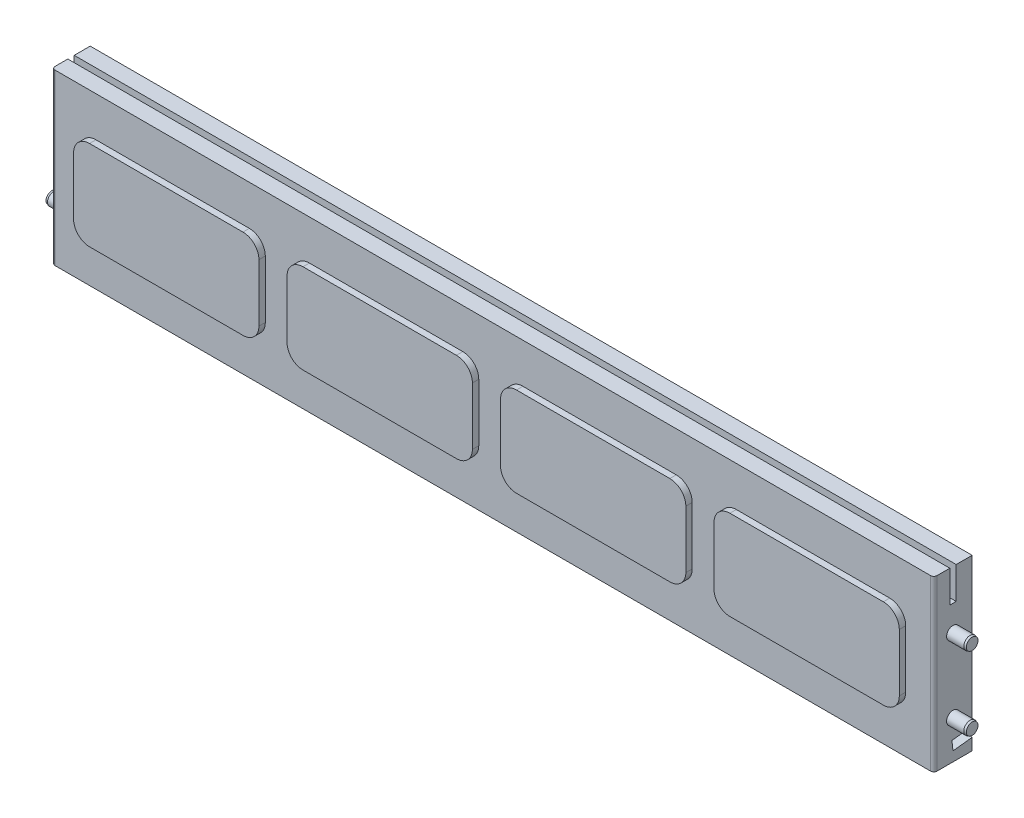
ISO-10303-21;
HEADER;
FILE_DESCRIPTION(('STEP AP214'),'2;1');
FILE_NAME('part.step','',(''),(''),'','','');
FILE_SCHEMA(('AUTOMOTIVE_DESIGN { 1 0 10303 214 1 1 1 1 }'));
ENDSEC;
DATA;
#1=APPLICATION_CONTEXT('core data for automotive mechanical design processes');
#2=APPLICATION_PROTOCOL_DEFINITION('international standard','automotive_design',2000,#1);
#3=PRODUCT_CONTEXT('',#1,'mechanical');
#4=PRODUCT('Part','Part','',(#3));
#5=PRODUCT_RELATED_PRODUCT_CATEGORY('part','',(#4));
#6=PRODUCT_DEFINITION_FORMATION('','',#4);
#7=PRODUCT_DEFINITION_CONTEXT('part definition',#1,'design');
#8=PRODUCT_DEFINITION('design','',#6,#7);
#9=PRODUCT_DEFINITION_SHAPE('','',#8);
#10=(LENGTH_UNIT() NAMED_UNIT(*) SI_UNIT(.MILLI.,.METRE.));
#11=(NAMED_UNIT(*) PLANE_ANGLE_UNIT() SI_UNIT($,.RADIAN.));
#12=(NAMED_UNIT(*) SI_UNIT($,.STERADIAN.) SOLID_ANGLE_UNIT());
#13=UNCERTAINTY_MEASURE_WITH_UNIT(LENGTH_MEASURE(1.E-05),#10,'distance_accuracy_value','');
#14=(GEOMETRIC_REPRESENTATION_CONTEXT(3) GLOBAL_UNCERTAINTY_ASSIGNED_CONTEXT((#13)) GLOBAL_UNIT_ASSIGNED_CONTEXT((#10,
#11,#12)) REPRESENTATION_CONTEXT('',''));
#15=CARTESIAN_POINT('',(0.,0.,0.));
#16=DIRECTION('',(0.,0.,1.));
#17=DIRECTION('',(1.,0.,0.));
#18=AXIS2_PLACEMENT_3D('',#15,#16,#17);
#19=CARTESIAN_POINT('',(-234.,25.8311920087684,99.));
#20=DIRECTION('',(1.,0.,0.));
#21=DIRECTION('',(0.,0.,-1.));
#22=AXIS2_PLACEMENT_3D('',#19,#20,#21);
#23=PLANE('',#22);
#24=CARTESIAN_POINT('',(-234.,24.,99.));
#25=DIRECTION('',(-1.,0.,0.));
#26=DIRECTION('',(0.,0.,1.));
#27=AXIS2_PLACEMENT_3D('',#24,#25,#26);
#28=CIRCLE('',#27,1.8311920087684);
#29=CARTESIAN_POINT('',(-234.,24.,100.831192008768));
#30=VERTEX_POINT('',#29);
#31=EDGE_CURVE('E59',#30,#30,#28,.T.);
#32=ORIENTED_EDGE('',*,*,#31,.T.);
#33=EDGE_LOOP('',(#32));
#34=FACE_BOUND('',#33,.T.);
#35=ADVANCED_FACE('F45',(#34),#23,.F.);
#36=CARTESIAN_POINT('',(-214.,24.,99.));
#37=DIRECTION('',(-1.,0.,0.));
#38=DIRECTION('',(0.,0.,1.));
#39=AXIS2_PLACEMENT_3D('',#36,#37,#38);
#40=PLANE('',#39);
#41=CARTESIAN_POINT('',(-214.,24.,99.));
#42=DIRECTION('',(-1.,0.,0.));
#43=DIRECTION('',(0.,0.,1.));
#44=AXIS2_PLACEMENT_3D('',#41,#42,#43);
#45=CIRCLE('',#44,1.8311920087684);
#46=CARTESIAN_POINT('',(-214.,24.,100.831192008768));
#47=VERTEX_POINT('',#46);
#48=EDGE_CURVE('E11',#47,#47,#45,.T.);
#49=ORIENTED_EDGE('',*,*,#48,.F.);
#50=EDGE_LOOP('',(#49));
#51=FACE_BOUND('',#50,.T.);
#52=ADVANCED_FACE('F79',(#51),#40,.F.);
#53=CARTESIAN_POINT('',(-214.,24.,99.));
#54=DIRECTION('',(-1.,0.,0.));
#55=DIRECTION('',(0.,0.,1.));
#56=AXIS2_PLACEMENT_3D('',#53,#54,#55);
#57=CONICAL_SURFACE('',#56,1.8311920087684,0.261799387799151);
#58=CARTESIAN_POINT('',(-214.63,24.,99.));
#59=DIRECTION('',(-1.,0.,0.));
#60=DIRECTION('',(0.,0.,1.));
#61=AXIS2_PLACEMENT_3D('',#58,#59,#60);
#62=CIRCLE('',#61,2.);
#63=CARTESIAN_POINT('',(-214.63,24.,101.));
#64=VERTEX_POINT('',#63);
#65=EDGE_CURVE('E51',#64,#64,#62,.T.);
#66=ORIENTED_EDGE('',*,*,#65,.F.);
#67=EDGE_LOOP('',(#66));
#68=FACE_BOUND('',#67,.T.);
#69=ORIENTED_EDGE('',*,*,#48,.T.);
#70=EDGE_LOOP('',(#69));
#71=FACE_BOUND('',#70,.T.);
#72=ADVANCED_FACE('F74',(#68,#71),#57,.T.);
#73=CARTESIAN_POINT('',(-240.35,24.,99.));
#74=DIRECTION('',(-1.,0.,0.));
#75=DIRECTION('',(0.,0.,1.));
#76=AXIS2_PLACEMENT_3D('',#73,#74,#75);
#77=CYLINDRICAL_SURFACE('',#76,2.);
#78=CARTESIAN_POINT('',(-233.37,24.,99.));
#79=DIRECTION('',(-1.,0.,0.));
#80=DIRECTION('',(0.,0.,1.));
#81=AXIS2_PLACEMENT_3D('',#78,#79,#80);
#82=CIRCLE('',#81,2.);
#83=CARTESIAN_POINT('',(-233.37,24.,101.));
#84=VERTEX_POINT('',#83);
#85=EDGE_CURVE('E55',#84,#84,#82,.T.);
#86=ORIENTED_EDGE('',*,*,#85,.F.);
#87=EDGE_LOOP('',(#86));
#88=FACE_BOUND('',#87,.T.);
#89=ORIENTED_EDGE('',*,*,#65,.T.);
#90=EDGE_LOOP('',(#89));
#91=FACE_BOUND('',#90,.T.);
#92=ADVANCED_FACE('F69',(#88,#91),#77,.T.);
#93=CARTESIAN_POINT('',(-233.37,24.,99.));
#94=DIRECTION('',(1.,0.,0.));
#95=DIRECTION('',(0.,0.,-1.));
#96=AXIS2_PLACEMENT_3D('',#93,#94,#95);
#97=CONICAL_SURFACE('',#96,2.,0.261799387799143);
#98=ORIENTED_EDGE('',*,*,#31,.F.);
#99=EDGE_LOOP('',(#98));
#100=FACE_BOUND('',#99,.T.);
#101=ORIENTED_EDGE('',*,*,#85,.T.);
#102=EDGE_LOOP('',(#101));
#103=FACE_BOUND('',#102,.T.);
#104=ADVANCED_FACE('F66',(#100,#103),#97,.T.);
#105=CLOSED_SHELL('',(#35,#52,#72,#92,#104));
#106=MANIFOLD_SOLID_BREP('B2',#105);
#107=CARTESIAN_POINT('',(34.,25.8311920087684,99.));
#108=DIRECTION('',(1.,0.,0.));
#109=DIRECTION('',(0.,0.,-1.));
#110=AXIS2_PLACEMENT_3D('',#107,#108,#109);
#111=PLANE('',#110);
#112=CARTESIAN_POINT('',(34.,24.,99.));
#113=DIRECTION('',(-1.,0.,0.));
#114=DIRECTION('',(0.,0.,1.));
#115=AXIS2_PLACEMENT_3D('',#112,#113,#114);
#116=CIRCLE('',#115,1.8311920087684);
#117=CARTESIAN_POINT('',(34.,24.,100.831192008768));
#118=VERTEX_POINT('',#117);
#119=EDGE_CURVE('E127',#118,#118,#116,.T.);
#120=ORIENTED_EDGE('',*,*,#119,.T.);
#121=EDGE_LOOP('',(#120));
#122=FACE_BOUND('',#121,.T.);
#123=ADVANCED_FACE('F113',(#122),#111,.F.);
#124=CARTESIAN_POINT('',(54.,24.,99.));
#125=DIRECTION('',(-1.,0.,0.));
#126=DIRECTION('',(0.,0.,1.));
#127=AXIS2_PLACEMENT_3D('',#124,#125,#126);
#128=PLANE('',#127);
#129=CARTESIAN_POINT('',(54.,24.,99.));
#130=DIRECTION('',(-1.,0.,0.));
#131=DIRECTION('',(0.,0.,1.));
#132=AXIS2_PLACEMENT_3D('',#129,#130,#131);
#133=CIRCLE('',#132,1.8311920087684);
#134=CARTESIAN_POINT('',(54.,24.,100.831192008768));
#135=VERTEX_POINT('',#134);
#136=EDGE_CURVE('E44',#135,#135,#133,.T.);
#137=ORIENTED_EDGE('',*,*,#136,.F.);
#138=EDGE_LOOP('',(#137));
#139=FACE_BOUND('',#138,.T.);
#140=ADVANCED_FACE('F147',(#139),#128,.F.);
#141=CARTESIAN_POINT('',(54.,24.,99.));
#142=DIRECTION('',(-1.,0.,0.));
#143=DIRECTION('',(0.,0.,1.));
#144=AXIS2_PLACEMENT_3D('',#141,#142,#143);
#145=CONICAL_SURFACE('',#144,1.8311920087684,0.261799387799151);
#146=CARTESIAN_POINT('',(53.37,24.,99.));
#147=DIRECTION('',(-1.,0.,0.));
#148=DIRECTION('',(0.,0.,1.));
#149=AXIS2_PLACEMENT_3D('',#146,#147,#148);
#150=CIRCLE('',#149,2.);
#151=CARTESIAN_POINT('',(53.37,24.,101.));
#152=VERTEX_POINT('',#151);
#153=EDGE_CURVE('E119',#152,#152,#150,.T.);
#154=ORIENTED_EDGE('',*,*,#153,.F.);
#155=EDGE_LOOP('',(#154));
#156=FACE_BOUND('',#155,.T.);
#157=ORIENTED_EDGE('',*,*,#136,.T.);
#158=EDGE_LOOP('',(#157));
#159=FACE_BOUND('',#158,.T.);
#160=ADVANCED_FACE('F142',(#156,#159),#145,.T.);
#161=CARTESIAN_POINT('',(27.65,24.,99.));
#162=DIRECTION('',(-1.,0.,0.));
#163=DIRECTION('',(0.,0.,1.));
#164=AXIS2_PLACEMENT_3D('',#161,#162,#163);
#165=CYLINDRICAL_SURFACE('',#164,2.);
#166=CARTESIAN_POINT('',(34.63,24.,99.));
#167=DIRECTION('',(-1.,0.,0.));
#168=DIRECTION('',(0.,0.,1.));
#169=AXIS2_PLACEMENT_3D('',#166,#167,#168);
#170=CIRCLE('',#169,2.);
#171=CARTESIAN_POINT('',(34.63,24.,101.));
#172=VERTEX_POINT('',#171);
#173=EDGE_CURVE('E123',#172,#172,#170,.T.);
#174=ORIENTED_EDGE('',*,*,#173,.F.);
#175=EDGE_LOOP('',(#174));
#176=FACE_BOUND('',#175,.T.);
#177=ORIENTED_EDGE('',*,*,#153,.T.);
#178=EDGE_LOOP('',(#177));
#179=FACE_BOUND('',#178,.T.);
#180=ADVANCED_FACE('F137',(#176,#179),#165,.T.);
#181=CARTESIAN_POINT('',(34.63,24.,99.));
#182=DIRECTION('',(1.,0.,0.));
#183=DIRECTION('',(0.,0.,-1.));
#184=AXIS2_PLACEMENT_3D('',#181,#182,#183);
#185=CONICAL_SURFACE('',#184,2.,0.261799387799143);
#186=ORIENTED_EDGE('',*,*,#119,.F.);
#187=EDGE_LOOP('',(#186));
#188=FACE_BOUND('',#187,.T.);
#189=ORIENTED_EDGE('',*,*,#173,.T.);
#190=EDGE_LOOP('',(#189));
#191=FACE_BOUND('',#190,.T.);
#192=ADVANCED_FACE('F134',(#188,#191),#185,.T.);
#193=CLOSED_SHELL('',(#123,#140,#160,#180,#192));
#194=MANIFOLD_SOLID_BREP('B6',#193);
#195=CARTESIAN_POINT('',(34.,48.8311920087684,99.));
#196=DIRECTION('',(1.,0.,0.));
#197=DIRECTION('',(0.,0.,-1.));
#198=AXIS2_PLACEMENT_3D('',#195,#196,#197);
#199=PLANE('',#198);
#200=CARTESIAN_POINT('',(34.,47.,99.));
#201=DIRECTION('',(-1.,0.,0.));
#202=DIRECTION('',(0.,0.,1.));
#203=AXIS2_PLACEMENT_3D('',#200,#201,#202);
#204=CIRCLE('',#203,1.8311920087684);
#205=CARTESIAN_POINT('',(34.,47.,100.831192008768));
#206=VERTEX_POINT('',#205);
#207=EDGE_CURVE('E196',#206,#206,#204,.T.);
#208=ORIENTED_EDGE('',*,*,#207,.T.);
#209=EDGE_LOOP('',(#208));
#210=FACE_BOUND('',#209,.T.);
#211=ADVANCED_FACE('F182',(#210),#199,.F.);
#212=CARTESIAN_POINT('',(54.,47.,99.));
#213=DIRECTION('',(-1.,0.,0.));
#214=DIRECTION('',(0.,0.,1.));
#215=AXIS2_PLACEMENT_3D('',#212,#213,#214);
#216=PLANE('',#215);
#217=CARTESIAN_POINT('',(54.,47.,99.));
#218=DIRECTION('',(-1.,0.,0.));
#219=DIRECTION('',(0.,0.,1.));
#220=AXIS2_PLACEMENT_3D('',#217,#218,#219);
#221=CIRCLE('',#220,1.8311920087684);
#222=CARTESIAN_POINT('',(54.,47.,100.831192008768));
#223=VERTEX_POINT('',#222);
#224=EDGE_CURVE('E112',#223,#223,#221,.T.);
#225=ORIENTED_EDGE('',*,*,#224,.F.);
#226=EDGE_LOOP('',(#225));
#227=FACE_BOUND('',#226,.T.);
#228=ADVANCED_FACE('F216',(#227),#216,.F.);
#229=CARTESIAN_POINT('',(54.,47.,99.));
#230=DIRECTION('',(-1.,0.,0.));
#231=DIRECTION('',(0.,0.,1.));
#232=AXIS2_PLACEMENT_3D('',#229,#230,#231);
#233=CONICAL_SURFACE('',#232,1.8311920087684,0.261799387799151);
#234=CARTESIAN_POINT('',(53.37,47.,99.));
#235=DIRECTION('',(-1.,0.,0.));
#236=DIRECTION('',(0.,0.,1.));
#237=AXIS2_PLACEMENT_3D('',#234,#235,#236);
#238=CIRCLE('',#237,2.);
#239=CARTESIAN_POINT('',(53.37,47.,101.));
#240=VERTEX_POINT('',#239);
#241=EDGE_CURVE('E188',#240,#240,#238,.T.);
#242=ORIENTED_EDGE('',*,*,#241,.F.);
#243=EDGE_LOOP('',(#242));
#244=FACE_BOUND('',#243,.T.);
#245=ORIENTED_EDGE('',*,*,#224,.T.);
#246=EDGE_LOOP('',(#245));
#247=FACE_BOUND('',#246,.T.);
#248=ADVANCED_FACE('F211',(#244,#247),#233,.T.);
#249=CARTESIAN_POINT('',(27.65,47.,99.));
#250=DIRECTION('',(-1.,0.,0.));
#251=DIRECTION('',(0.,0.,1.));
#252=AXIS2_PLACEMENT_3D('',#249,#250,#251);
#253=CYLINDRICAL_SURFACE('',#252,2.);
#254=CARTESIAN_POINT('',(34.63,47.,99.));
#255=DIRECTION('',(-1.,0.,0.));
#256=DIRECTION('',(0.,0.,1.));
#257=AXIS2_PLACEMENT_3D('',#254,#255,#256);
#258=CIRCLE('',#257,2.);
#259=CARTESIAN_POINT('',(34.63,47.,101.));
#260=VERTEX_POINT('',#259);
#261=EDGE_CURVE('E192',#260,#260,#258,.T.);
#262=ORIENTED_EDGE('',*,*,#261,.F.);
#263=EDGE_LOOP('',(#262));
#264=FACE_BOUND('',#263,.T.);
#265=ORIENTED_EDGE('',*,*,#241,.T.);
#266=EDGE_LOOP('',(#265));
#267=FACE_BOUND('',#266,.T.);
#268=ADVANCED_FACE('F206',(#264,#267),#253,.T.);
#269=CARTESIAN_POINT('',(34.63,47.,99.));
#270=DIRECTION('',(1.,0.,0.));
#271=DIRECTION('',(0.,0.,-1.));
#272=AXIS2_PLACEMENT_3D('',#269,#270,#271);
#273=CONICAL_SURFACE('',#272,2.,0.261799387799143);
#274=ORIENTED_EDGE('',*,*,#207,.F.);
#275=EDGE_LOOP('',(#274));
#276=FACE_BOUND('',#275,.T.);
#277=ORIENTED_EDGE('',*,*,#261,.T.);
#278=EDGE_LOOP('',(#277));
#279=FACE_BOUND('',#278,.T.);
#280=ADVANCED_FACE('F203',(#276,#279),#273,.T.);
#281=CLOSED_SHELL('',(#211,#228,#248,#268,#280));
#282=MANIFOLD_SOLID_BREP('B39',#281);
#283=CARTESIAN_POINT('',(-228.,12.,93.));
#284=DIRECTION('',(-1.,0.,0.));
#285=DIRECTION('',(0.,0.,1.));
#286=AXIS2_PLACEMENT_3D('',#283,#284,#285);
#287=PLANE('',#286);
#288=CARTESIAN_POINT('',(-228.,24.,99.));
#289=DIRECTION('',(-1.,0.,0.));
#290=DIRECTION('',(0.,0.,1.));
#291=AXIS2_PLACEMENT_3D('',#288,#289,#290);
#292=CIRCLE('',#291,1.99999999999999);
#293=CARTESIAN_POINT('',(-228.,24.,101.));
#294=VERTEX_POINT('',#293);
#295=EDGE_CURVE('E1248',#294,#294,#292,.T.);
#296=ORIENTED_EDGE('',*,*,#295,.F.);
#297=EDGE_LOOP('',(#296));
#298=FACE_BOUND('',#297,.T.);
#299=CARTESIAN_POINT('',(-228.,47.,99.));
#300=DIRECTION('',(-1.,0.,0.));
#301=DIRECTION('',(0.,0.,1.));
#302=AXIS2_PLACEMENT_3D('',#299,#300,#301);
#303=CIRCLE('',#302,2.25);
#304=CARTESIAN_POINT('',(-228.,47.,101.25));
#305=VERTEX_POINT('',#304);
#306=EDGE_CURVE('E548',#305,#305,#303,.T.);
#307=ORIENTED_EDGE('',*,*,#306,.F.);
#308=EDGE_LOOP('',(#307));
#309=FACE_BOUND('',#308,.T.);
#310=DIRECTION('',(0.,0.,1.));
#311=VECTOR('',#310,1.);
#312=CARTESIAN_POINT('',(-228.,12.,93.));
#313=LINE('',#312,#311);
#314=CARTESIAN_POINT('',(-228.,12.,93.));
#315=VERTEX_POINT('',#314);
#316=CARTESIAN_POINT('',(-228.,12.,104.));
#317=VERTEX_POINT('',#316);
#318=EDGE_CURVE('E868',#315,#317,#313,.T.);
#319=ORIENTED_EDGE('',*,*,#318,.T.);
#320=DIRECTION('',(0.,-1.,0.));
#321=VECTOR('',#320,1.);
#322=CARTESIAN_POINT('',(-228.,65.,104.));
#323=LINE('',#322,#321);
#324=CARTESIAN_POINT('',(-228.,65.,104.));
#325=VERTEX_POINT('',#324);
#326=EDGE_CURVE('E180',#317,#325,#323,.F.);
#327=ORIENTED_EDGE('',*,*,#326,.T.);
#328=DIRECTION('',(0.,0.,1.));
#329=VECTOR('',#328,1.);
#330=CARTESIAN_POINT('',(-228.,65.,93.));
#331=LINE('',#330,#329);
#332=CARTESIAN_POINT('',(-228.,65.,100.));
#333=VERTEX_POINT('',#332);
#334=EDGE_CURVE('E878',#333,#325,#331,.T.);
#335=ORIENTED_EDGE('',*,*,#334,.F.);
#336=DIRECTION('',(0.,-1.,0.));
#337=VECTOR('',#336,1.);
#338=CARTESIAN_POINT('',(-228.,12.,100.));
#339=LINE('',#338,#337);
#340=CARTESIAN_POINT('',(-228.,55.,100.));
#341=VERTEX_POINT('',#340);
#342=EDGE_CURVE('E850',#333,#341,#339,.T.);
#343=ORIENTED_EDGE('',*,*,#342,.T.);
#344=DIRECTION('',(0.,0.,1.));
#345=VECTOR('',#344,1.);
#346=CARTESIAN_POINT('',(-228.,55.,93.));
#347=LINE('',#346,#345);
#348=CARTESIAN_POINT('',(-228.,55.,98.));
#349=VERTEX_POINT('',#348);
#350=EDGE_CURVE('E845',#349,#341,#347,.T.);
#351=ORIENTED_EDGE('',*,*,#350,.F.);
#352=DIRECTION('',(0.,-1.,0.));
#353=VECTOR('',#352,1.);
#354=CARTESIAN_POINT('',(-228.,12.,98.));
#355=LINE('',#354,#353);
#356=CARTESIAN_POINT('',(-228.,65.,98.));
#357=VERTEX_POINT('',#356);
#358=EDGE_CURVE('E843',#357,#349,#355,.T.);
#359=ORIENTED_EDGE('',*,*,#358,.F.);
#360=CARTESIAN_POINT('',(-228.,65.,93.));
#361=VERTEX_POINT('',#360);
#362=EDGE_CURVE('E874',#361,#357,#331,.T.);
#363=ORIENTED_EDGE('',*,*,#362,.F.);
#364=DIRECTION('',(0.,-1.,0.));
#365=VECTOR('',#364,1.);
#366=CARTESIAN_POINT('',(-228.,12.,93.));
#367=LINE('',#366,#365);
#368=CARTESIAN_POINT('',(-228.,18.6851283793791,93.));
#369=VERTEX_POINT('',#368);
#370=EDGE_CURVE('E854',#361,#369,#367,.T.);
#371=ORIENTED_EDGE('',*,*,#370,.T.);
#372=DIRECTION('',(0.,0.110431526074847,-0.993883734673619));
#373=VECTOR('',#372,1.);
#374=CARTESIAN_POINT('',(-228.,18.6036024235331,93.7337336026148));
#375=LINE('',#374,#373);
#376=CARTESIAN_POINT('',(-228.,17.9816512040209,99.3312945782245));
#377=VERTEX_POINT('',#376);
#378=EDGE_CURVE('E566',#377,#369,#375,.T.);
#379=ORIENTED_EDGE('',*,*,#378,.F.);
#380=DIRECTION('',(0.,0.993883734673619,0.110431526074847));
#381=VECTOR('',#380,1.);
#382=CARTESIAN_POINT('',(-228.,11.3780487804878,98.5975609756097));
#383=LINE('',#382,#381);
#384=CARTESIAN_POINT('',(-228.,15.,99.));
#385=VERTEX_POINT('',#384);
#386=EDGE_CURVE('E574',#385,#377,#383,.T.);
#387=ORIENTED_EDGE('',*,*,#386,.F.);
#388=DIRECTION('',(0.,0.110431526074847,-0.993883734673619));
#389=VECTOR('',#388,1.);
#390=CARTESIAN_POINT('',(-228.,15.6219512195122,93.4024390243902));
#391=LINE('',#390,#389);
#392=CARTESIAN_POINT('',(-228.,15.6666666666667,93.));
#393=VERTEX_POINT('',#392);
#394=EDGE_CURVE('E571',#385,#393,#391,.T.);
#395=ORIENTED_EDGE('',*,*,#394,.T.);
#396=EDGE_CURVE('E858',#393,#315,#367,.T.);
#397=ORIENTED_EDGE('',*,*,#396,.T.);
#398=EDGE_LOOP('',(#319,#327,#335,#343,#351,#359,#363,#371,#379,#387,#395,#397));
#399=FACE_BOUND('',#398,.T.);
#400=ADVANCED_FACE('F243',(#298,#309,#399),#287,.T.);
#401=CARTESIAN_POINT('',(48.,12.,93.));
#402=DIRECTION('',(1.,0.,0.));
#403=DIRECTION('',(0.,0.,-1.));
#404=AXIS2_PLACEMENT_3D('',#401,#402,#403);
#405=PLANE('',#404);
#406=CARTESIAN_POINT('',(48.,47.,99.));
#407=DIRECTION('',(1.,0.,0.));
#408=DIRECTION('',(0.,0.,-1.));
#409=AXIS2_PLACEMENT_3D('',#406,#407,#408);
#410=CIRCLE('',#409,2.);
#411=CARTESIAN_POINT('',(48.,47.,97.));
#412=VERTEX_POINT('',#411);
#413=EDGE_CURVE('E1250',#412,#412,#410,.T.);
#414=ORIENTED_EDGE('',*,*,#413,.F.);
#415=EDGE_LOOP('',(#414));
#416=FACE_BOUND('',#415,.T.);
#417=CARTESIAN_POINT('',(48.,24.,99.));
#418=DIRECTION('',(1.,0.,0.));
#419=DIRECTION('',(0.,0.,-1.));
#420=AXIS2_PLACEMENT_3D('',#417,#418,#419);
#421=CIRCLE('',#420,2.);
#422=CARTESIAN_POINT('',(48.,24.,97.));
#423=VERTEX_POINT('',#422);
#424=EDGE_CURVE('E555',#423,#423,#421,.T.);
#425=ORIENTED_EDGE('',*,*,#424,.F.);
#426=EDGE_LOOP('',(#425));
#427=FACE_BOUND('',#426,.T.);
#428=DIRECTION('',(0.,0.,1.));
#429=VECTOR('',#428,1.);
#430=CARTESIAN_POINT('',(48.,65.,93.));
#431=LINE('',#430,#429);
#432=CARTESIAN_POINT('',(48.,65.,100.));
#433=VERTEX_POINT('',#432);
#434=CARTESIAN_POINT('',(48.,65.,104.));
#435=VERTEX_POINT('',#434);
#436=EDGE_CURVE('E882',#433,#435,#431,.T.);
#437=ORIENTED_EDGE('',*,*,#436,.T.);
#438=DIRECTION('',(0.,1.,0.));
#439=VECTOR('',#438,1.);
#440=CARTESIAN_POINT('',(48.,12.,104.));
#441=LINE('',#440,#439);
#442=CARTESIAN_POINT('',(48.,12.,104.));
#443=VERTEX_POINT('',#442);
#444=EDGE_CURVE('E266',#435,#443,#441,.F.);
#445=ORIENTED_EDGE('',*,*,#444,.T.);
#446=DIRECTION('',(0.,0.,1.));
#447=VECTOR('',#446,1.);
#448=CARTESIAN_POINT('',(48.,12.,93.));
#449=LINE('',#448,#447);
#450=CARTESIAN_POINT('',(48.,12.,93.));
#451=VERTEX_POINT('',#450);
#452=EDGE_CURVE('E883',#451,#443,#449,.T.);
#453=ORIENTED_EDGE('',*,*,#452,.F.);
#454=DIRECTION('',(0.,1.,0.));
#455=VECTOR('',#454,1.);
#456=CARTESIAN_POINT('',(48.,12.,93.));
#457=LINE('',#456,#455);
#458=CARTESIAN_POINT('',(48.,15.6666666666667,93.));
#459=VERTEX_POINT('',#458);
#460=EDGE_CURVE('E862',#451,#459,#457,.T.);
#461=ORIENTED_EDGE('',*,*,#460,.T.);
#462=DIRECTION('',(0.,-0.110431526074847,0.993883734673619));
#463=VECTOR('',#462,1.);
#464=CARTESIAN_POINT('',(48.,15.6219512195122,93.4024390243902));
#465=LINE('',#464,#463);
#466=CARTESIAN_POINT('',(48.,15.,99.));
#467=VERTEX_POINT('',#466);
#468=EDGE_CURVE('E568',#459,#467,#465,.T.);
#469=ORIENTED_EDGE('',*,*,#468,.T.);
#470=DIRECTION('',(0.,-0.993883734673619,-0.110431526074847));
#471=VECTOR('',#470,1.);
#472=CARTESIAN_POINT('',(48.,11.3780487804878,98.5975609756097));
#473=LINE('',#472,#471);
#474=CARTESIAN_POINT('',(48.,17.9816512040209,99.3312945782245));
#475=VERTEX_POINT('',#474);
#476=EDGE_CURVE('E898',#475,#467,#473,.T.);
#477=ORIENTED_EDGE('',*,*,#476,.F.);
#478=DIRECTION('',(0.,-0.110431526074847,0.993883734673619));
#479=VECTOR('',#478,1.);
#480=CARTESIAN_POINT('',(48.,18.6036024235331,93.7337336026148));
#481=LINE('',#480,#479);
#482=CARTESIAN_POINT('',(48.,18.6851283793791,93.));
#483=VERTEX_POINT('',#482);
#484=EDGE_CURVE('E562',#483,#475,#481,.T.);
#485=ORIENTED_EDGE('',*,*,#484,.F.);
#486=CARTESIAN_POINT('',(48.,65.,93.));
#487=VERTEX_POINT('',#486);
#488=EDGE_CURVE('E861',#483,#487,#457,.T.);
#489=ORIENTED_EDGE('',*,*,#488,.T.);
#490=CARTESIAN_POINT('',(48.,65.,98.));
#491=VERTEX_POINT('',#490);
#492=EDGE_CURVE('E879',#487,#491,#431,.T.);
#493=ORIENTED_EDGE('',*,*,#492,.T.);
#494=DIRECTION('',(0.,1.,0.));
#495=VECTOR('',#494,1.);
#496=CARTESIAN_POINT('',(48.,12.,98.));
#497=LINE('',#496,#495);
#498=CARTESIAN_POINT('',(48.,55.,98.));
#499=VERTEX_POINT('',#498);
#500=EDGE_CURVE('E877',#499,#491,#497,.T.);
#501=ORIENTED_EDGE('',*,*,#500,.F.);
#502=DIRECTION('',(0.,0.,-1.));
#503=VECTOR('',#502,1.);
#504=CARTESIAN_POINT('',(48.,55.,93.));
#505=LINE('',#504,#503);
#506=CARTESIAN_POINT('',(47.9999999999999,55.,100.));
#507=VERTEX_POINT('',#506);
#508=EDGE_CURVE('E887',#507,#499,#505,.T.);
#509=ORIENTED_EDGE('',*,*,#508,.F.);
#510=DIRECTION('',(0.,1.,0.));
#511=VECTOR('',#510,1.);
#512=CARTESIAN_POINT('',(48.,12.,100.));
#513=LINE('',#512,#511);
#514=EDGE_CURVE('E890',#507,#433,#513,.T.);
#515=ORIENTED_EDGE('',*,*,#514,.T.);
#516=EDGE_LOOP('',(#437,#445,#453,#461,#469,#477,#485,#489,#493,#501,#509,#515));
#517=FACE_BOUND('',#516,.T.);
#518=ADVANCED_FACE('F924',(#416,#427,#517),#405,.T.);
#519=CARTESIAN_POINT('',(0.,0.,93.));
#520=DIRECTION('',(0.,0.,-1.));
#521=DIRECTION('',(-1.,0.,0.));
#522=AXIS2_PLACEMENT_3D('',#519,#520,#521);
#523=PLANE('',#522);
#524=ORIENTED_EDGE('',*,*,#396,.F.);
#525=DIRECTION('',(1.,0.,0.));
#526=VECTOR('',#525,1.);
#527=CARTESIAN_POINT('',(0.,15.6666666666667,93.));
#528=LINE('',#527,#526);
#529=EDGE_CURVE('E895',#393,#459,#528,.T.);
#530=ORIENTED_EDGE('',*,*,#529,.T.);
#531=ORIENTED_EDGE('',*,*,#460,.F.);
#532=DIRECTION('',(1.,0.,0.));
#533=VECTOR('',#532,1.);
#534=CARTESIAN_POINT('',(-228.,12.,93.));
#535=LINE('',#534,#533);
#536=EDGE_CURVE('E857',#315,#451,#535,.T.);
#537=ORIENTED_EDGE('',*,*,#536,.F.);
#538=EDGE_LOOP('',(#524,#530,#531,#537));
#539=FACE_BOUND('',#538,.T.);
#540=ADVANCED_FACE('F945',(#539),#523,.T.);
#541=CARTESIAN_POINT('',(0.,0.,105.));
#542=DIRECTION('',(0.,0.,-1.));
#543=DIRECTION('',(-1.,0.,0.));
#544=AXIS2_PLACEMENT_3D('',#541,#542,#543);
#545=PLANE('',#544);
#546=CARTESIAN_POINT('',(-32.6,47.5,105.));
#547=DIRECTION('',(0.,0.,1.));
#548=DIRECTION('',(-1.,0.,0.));
#549=AXIS2_PLACEMENT_3D('',#546,#547,#548);
#550=CIRCLE('',#549,5.);
#551=CARTESIAN_POINT('',(-27.6,47.5,105.));
#552=VERTEX_POINT('',#551);
#553=CARTESIAN_POINT('',(-32.6,52.5,105.));
#554=VERTEX_POINT('',#553);
#555=EDGE_CURVE('E641',#552,#554,#550,.T.);
#556=ORIENTED_EDGE('',*,*,#555,.F.);
#557=DIRECTION('',(0.,1.,0.));
#558=VECTOR('',#557,1.);
#559=CARTESIAN_POINT('',(-27.6,47.5,105.));
#560=LINE('',#559,#558);
#561=CARTESIAN_POINT('',(-27.6,29.5,105.));
#562=VERTEX_POINT('',#561);
#563=EDGE_CURVE('E646',#562,#552,#560,.T.);
#564=ORIENTED_EDGE('',*,*,#563,.F.);
#565=CARTESIAN_POINT('',(-32.6,29.5,105.));
#566=DIRECTION('',(0.,0.,1.));
#567=DIRECTION('',(1.,0.,0.));
#568=AXIS2_PLACEMENT_3D('',#565,#566,#567);
#569=CIRCLE('',#568,5.);
#570=CARTESIAN_POINT('',(-32.6,24.5,105.));
#571=VERTEX_POINT('',#570);
#572=EDGE_CURVE('E678',#571,#562,#569,.T.);
#573=ORIENTED_EDGE('',*,*,#572,.F.);
#574=DIRECTION('',(1.,0.,0.));
#575=VECTOR('',#574,1.);
#576=CARTESIAN_POINT('',(-80.6,24.5,105.));
#577=LINE('',#576,#575);
#578=CARTESIAN_POINT('',(-80.6,24.5,105.));
#579=VERTEX_POINT('',#578);
#580=EDGE_CURVE('E675',#579,#571,#577,.T.);
#581=ORIENTED_EDGE('',*,*,#580,.F.);
#582=CARTESIAN_POINT('',(-80.6,29.5,105.));
#583=DIRECTION('',(0.,0.,1.));
#584=DIRECTION('',(1.,0.,0.));
#585=AXIS2_PLACEMENT_3D('',#582,#583,#584);
#586=CIRCLE('',#585,5.);
#587=CARTESIAN_POINT('',(-85.6,29.5,105.));
#588=VERTEX_POINT('',#587);
#589=EDGE_CURVE('E672',#588,#579,#586,.T.);
#590=ORIENTED_EDGE('',*,*,#589,.F.);
#591=DIRECTION('',(0.,-1.,0.));
#592=VECTOR('',#591,1.);
#593=CARTESIAN_POINT('',(-85.6,47.5,105.));
#594=LINE('',#593,#592);
#595=CARTESIAN_POINT('',(-85.6,47.5,105.));
#596=VERTEX_POINT('',#595);
#597=EDGE_CURVE('E669',#596,#588,#594,.T.);
#598=ORIENTED_EDGE('',*,*,#597,.F.);
#599=CARTESIAN_POINT('',(-80.6,47.5,105.));
#600=DIRECTION('',(0.,0.,1.));
#601=DIRECTION('',(1.,0.,0.));
#602=AXIS2_PLACEMENT_3D('',#599,#600,#601);
#603=CIRCLE('',#602,5.);
#604=CARTESIAN_POINT('',(-80.6,52.5,105.));
#605=VERTEX_POINT('',#604);
#606=EDGE_CURVE('E666',#605,#596,#603,.T.);
#607=ORIENTED_EDGE('',*,*,#606,.F.);
#608=DIRECTION('',(-1.,0.,0.));
#609=VECTOR('',#608,1.);
#610=CARTESIAN_POINT('',(-80.6,52.5,105.));
#611=LINE('',#610,#609);
#612=EDGE_CURVE('E663',#554,#605,#611,.T.);
#613=ORIENTED_EDGE('',*,*,#612,.F.);
#614=EDGE_LOOP('',(#556,#564,#573,#581,#590,#598,#607,#613));
#615=FACE_BOUND('',#614,.T.);
#616=CARTESIAN_POINT('',(-166.2,47.5,105.));
#617=DIRECTION('',(0.,0.,1.));
#618=DIRECTION('',(-1.,0.,0.));
#619=AXIS2_PLACEMENT_3D('',#616,#617,#618);
#620=CIRCLE('',#619,5.);
#621=CARTESIAN_POINT('',(-161.2,47.5,105.));
#622=VERTEX_POINT('',#621);
#623=CARTESIAN_POINT('',(-166.2,52.5,105.));
#624=VERTEX_POINT('',#623);
#625=EDGE_CURVE('E771',#622,#624,#620,.T.);
#626=ORIENTED_EDGE('',*,*,#625,.F.);
#627=DIRECTION('',(0.,1.,0.));
#628=VECTOR('',#627,1.);
#629=CARTESIAN_POINT('',(-161.2,47.5,105.));
#630=LINE('',#629,#628);
#631=CARTESIAN_POINT('',(-161.2,29.5,105.));
#632=VERTEX_POINT('',#631);
#633=EDGE_CURVE('E776',#632,#622,#630,.T.);
#634=ORIENTED_EDGE('',*,*,#633,.F.);
#635=CARTESIAN_POINT('',(-166.2,29.5,105.));
#636=DIRECTION('',(0.,0.,1.));
#637=DIRECTION('',(1.,0.,0.));
#638=AXIS2_PLACEMENT_3D('',#635,#636,#637);
#639=CIRCLE('',#638,5.);
#640=CARTESIAN_POINT('',(-166.2,24.5,105.));
#641=VERTEX_POINT('',#640);
#642=EDGE_CURVE('E808',#641,#632,#639,.T.);
#643=ORIENTED_EDGE('',*,*,#642,.F.);
#644=DIRECTION('',(1.,0.,0.));
#645=VECTOR('',#644,1.);
#646=CARTESIAN_POINT('',(-214.2,24.5,105.));
#647=LINE('',#646,#645);
#648=CARTESIAN_POINT('',(-214.2,24.5,105.));
#649=VERTEX_POINT('',#648);
#650=EDGE_CURVE('E805',#649,#641,#647,.T.);
#651=ORIENTED_EDGE('',*,*,#650,.F.);
#652=CARTESIAN_POINT('',(-214.2,29.5,105.));
#653=DIRECTION('',(0.,0.,1.));
#654=DIRECTION('',(1.,0.,0.));
#655=AXIS2_PLACEMENT_3D('',#652,#653,#654);
#656=CIRCLE('',#655,5.);
#657=CARTESIAN_POINT('',(-219.2,29.5,105.));
#658=VERTEX_POINT('',#657);
#659=EDGE_CURVE('E802',#658,#649,#656,.T.);
#660=ORIENTED_EDGE('',*,*,#659,.F.);
#661=DIRECTION('',(0.,-1.,0.));
#662=VECTOR('',#661,1.);
#663=CARTESIAN_POINT('',(-219.2,47.5,105.));
#664=LINE('',#663,#662);
#665=CARTESIAN_POINT('',(-219.2,47.5,105.));
#666=VERTEX_POINT('',#665);
#667=EDGE_CURVE('E799',#666,#658,#664,.T.);
#668=ORIENTED_EDGE('',*,*,#667,.F.);
#669=CARTESIAN_POINT('',(-214.2,47.5,105.));
#670=DIRECTION('',(0.,0.,1.));
#671=DIRECTION('',(1.,0.,0.));
#672=AXIS2_PLACEMENT_3D('',#669,#670,#671);
#673=CIRCLE('',#672,5.);
#674=CARTESIAN_POINT('',(-214.2,52.5,105.));
#675=VERTEX_POINT('',#674);
#676=EDGE_CURVE('E796',#675,#666,#673,.T.);
#677=ORIENTED_EDGE('',*,*,#676,.F.);
#678=DIRECTION('',(-1.,0.,0.));
#679=VECTOR('',#678,1.);
#680=CARTESIAN_POINT('',(-214.2,52.5,105.));
#681=LINE('',#680,#679);
#682=EDGE_CURVE('E793',#624,#675,#681,.T.);
#683=ORIENTED_EDGE('',*,*,#682,.F.);
#684=EDGE_LOOP('',(#626,#634,#643,#651,#660,#668,#677,#683));
#685=FACE_BOUND('',#684,.T.);
#686=DIRECTION('',(1.,0.,0.));
#687=VECTOR('',#686,1.);
#688=CARTESIAN_POINT('',(-228.,12.,105.));
#689=LINE('',#688,#687);
#690=CARTESIAN_POINT('',(-227.,12.,105.));
#691=VERTEX_POINT('',#690);
#692=CARTESIAN_POINT('',(47.,12.,105.));
#693=VERTEX_POINT('',#692);
#694=EDGE_CURVE('E853',#691,#693,#689,.T.);
#695=ORIENTED_EDGE('',*,*,#694,.T.);
#696=DIRECTION('',(0.,1.,0.));
#697=VECTOR('',#696,1.);
#698=CARTESIAN_POINT('',(47.,65.,105.));
#699=LINE('',#698,#697);
#700=CARTESIAN_POINT('',(47.,65.,105.));
#701=VERTEX_POINT('',#700);
#702=EDGE_CURVE('E903',#693,#701,#699,.T.);
#703=ORIENTED_EDGE('',*,*,#702,.T.);
#704=DIRECTION('',(-1.,0.,0.));
#705=VECTOR('',#704,1.);
#706=CARTESIAN_POINT('',(-228.,65.,105.));
#707=LINE('',#706,#705);
#708=CARTESIAN_POINT('',(-227.,65.,105.));
#709=VERTEX_POINT('',#708);
#710=EDGE_CURVE('E871',#701,#709,#707,.T.);
#711=ORIENTED_EDGE('',*,*,#710,.T.);
#712=DIRECTION('',(0.,-1.,0.));
#713=VECTOR('',#712,1.);
#714=CARTESIAN_POINT('',(-227.,12.,105.));
#715=LINE('',#714,#713);
#716=EDGE_CURVE('E899',#709,#691,#715,.T.);
#717=ORIENTED_EDGE('',*,*,#716,.T.);
#718=EDGE_LOOP('',(#695,#703,#711,#717));
#719=FACE_BOUND('',#718,.T.);
#720=CARTESIAN_POINT('',(-99.4,47.5,105.));
#721=DIRECTION('',(0.,0.,1.));
#722=DIRECTION('',(-1.,0.,0.));
#723=AXIS2_PLACEMENT_3D('',#720,#721,#722);
#724=CIRCLE('',#723,5.);
#725=CARTESIAN_POINT('',(-94.4,47.5,105.));
#726=VERTEX_POINT('',#725);
#727=CARTESIAN_POINT('',(-99.4,52.5,105.));
#728=VERTEX_POINT('',#727);
#729=EDGE_CURVE('E706',#726,#728,#724,.T.);
#730=ORIENTED_EDGE('',*,*,#729,.F.);
#731=DIRECTION('',(0.,1.,0.));
#732=VECTOR('',#731,1.);
#733=CARTESIAN_POINT('',(-94.4,47.5,105.));
#734=LINE('',#733,#732);
#735=CARTESIAN_POINT('',(-94.4,29.5,105.));
#736=VERTEX_POINT('',#735);
#737=EDGE_CURVE('E711',#736,#726,#734,.T.);
#738=ORIENTED_EDGE('',*,*,#737,.F.);
#739=CARTESIAN_POINT('',(-99.4,29.5,105.));
#740=DIRECTION('',(0.,0.,1.));
#741=DIRECTION('',(1.,0.,0.));
#742=AXIS2_PLACEMENT_3D('',#739,#740,#741);
#743=CIRCLE('',#742,5.);
#744=CARTESIAN_POINT('',(-99.4,24.5,105.));
#745=VERTEX_POINT('',#744);
#746=EDGE_CURVE('E743',#745,#736,#743,.T.);
#747=ORIENTED_EDGE('',*,*,#746,.F.);
#748=DIRECTION('',(1.,0.,0.));
#749=VECTOR('',#748,1.);
#750=CARTESIAN_POINT('',(-147.4,24.5,105.));
#751=LINE('',#750,#749);
#752=CARTESIAN_POINT('',(-147.4,24.5,105.));
#753=VERTEX_POINT('',#752);
#754=EDGE_CURVE('E740',#753,#745,#751,.T.);
#755=ORIENTED_EDGE('',*,*,#754,.F.);
#756=CARTESIAN_POINT('',(-147.4,29.5,105.));
#757=DIRECTION('',(0.,0.,1.));
#758=DIRECTION('',(1.,0.,0.));
#759=AXIS2_PLACEMENT_3D('',#756,#757,#758);
#760=CIRCLE('',#759,5.);
#761=CARTESIAN_POINT('',(-152.4,29.5,105.));
#762=VERTEX_POINT('',#761);
#763=EDGE_CURVE('E737',#762,#753,#760,.T.);
#764=ORIENTED_EDGE('',*,*,#763,.F.);
#765=DIRECTION('',(0.,-1.,0.));
#766=VECTOR('',#765,1.);
#767=CARTESIAN_POINT('',(-152.4,47.5,105.));
#768=LINE('',#767,#766);
#769=CARTESIAN_POINT('',(-152.4,47.5,105.));
#770=VERTEX_POINT('',#769);
#771=EDGE_CURVE('E734',#770,#762,#768,.T.);
#772=ORIENTED_EDGE('',*,*,#771,.F.);
#773=CARTESIAN_POINT('',(-147.4,47.5,105.));
#774=DIRECTION('',(0.,0.,1.));
#775=DIRECTION('',(1.,0.,0.));
#776=AXIS2_PLACEMENT_3D('',#773,#774,#775);
#777=CIRCLE('',#776,5.);
#778=CARTESIAN_POINT('',(-147.4,52.5,105.));
#779=VERTEX_POINT('',#778);
#780=EDGE_CURVE('E731',#779,#770,#777,.T.);
#781=ORIENTED_EDGE('',*,*,#780,.F.);
#782=DIRECTION('',(-1.,0.,0.));
#783=VECTOR('',#782,1.);
#784=CARTESIAN_POINT('',(-147.4,52.5,105.));
#785=LINE('',#784,#783);
#786=EDGE_CURVE('E728',#728,#779,#785,.T.);
#787=ORIENTED_EDGE('',*,*,#786,.F.);
#788=EDGE_LOOP('',(#730,#738,#747,#755,#764,#772,#781,#787));
#789=FACE_BOUND('',#788,.T.);
#790=CARTESIAN_POINT('',(34.2,47.5,105.));
#791=DIRECTION('',(0.,0.,1.));
#792=DIRECTION('',(-1.,0.,0.));
#793=AXIS2_PLACEMENT_3D('',#790,#791,#792);
#794=CIRCLE('',#793,5.);
#795=CARTESIAN_POINT('',(39.2,47.5,105.));
#796=VERTEX_POINT('',#795);
#797=CARTESIAN_POINT('',(34.2,52.5,105.));
#798=VERTEX_POINT('',#797);
#799=EDGE_CURVE('E576',#796,#798,#794,.T.);
#800=ORIENTED_EDGE('',*,*,#799,.F.);
#801=DIRECTION('',(0.,1.,0.));
#802=VECTOR('',#801,1.);
#803=CARTESIAN_POINT('',(39.2,47.5,105.));
#804=LINE('',#803,#802);
#805=CARTESIAN_POINT('',(39.2,29.5,105.));
#806=VERTEX_POINT('',#805);
#807=EDGE_CURVE('E581',#806,#796,#804,.T.);
#808=ORIENTED_EDGE('',*,*,#807,.F.);
#809=CARTESIAN_POINT('',(34.2,29.5,105.));
#810=DIRECTION('',(0.,0.,1.));
#811=DIRECTION('',(1.,0.,0.));
#812=AXIS2_PLACEMENT_3D('',#809,#810,#811);
#813=CIRCLE('',#812,5.);
#814=CARTESIAN_POINT('',(34.2,24.5,105.));
#815=VERTEX_POINT('',#814);
#816=EDGE_CURVE('E613',#815,#806,#813,.T.);
#817=ORIENTED_EDGE('',*,*,#816,.F.);
#818=DIRECTION('',(1.,0.,0.));
#819=VECTOR('',#818,1.);
#820=CARTESIAN_POINT('',(-13.8,24.5,105.));
#821=LINE('',#820,#819);
#822=CARTESIAN_POINT('',(-13.8,24.5,105.));
#823=VERTEX_POINT('',#822);
#824=EDGE_CURVE('E610',#823,#815,#821,.T.);
#825=ORIENTED_EDGE('',*,*,#824,.F.);
#826=CARTESIAN_POINT('',(-13.8,29.5,105.));
#827=DIRECTION('',(0.,0.,1.));
#828=DIRECTION('',(1.,0.,0.));
#829=AXIS2_PLACEMENT_3D('',#826,#827,#828);
#830=CIRCLE('',#829,5.);
#831=CARTESIAN_POINT('',(-18.8,29.5,105.));
#832=VERTEX_POINT('',#831);
#833=EDGE_CURVE('E607',#832,#823,#830,.T.);
#834=ORIENTED_EDGE('',*,*,#833,.F.);
#835=DIRECTION('',(0.,-1.,0.));
#836=VECTOR('',#835,1.);
#837=CARTESIAN_POINT('',(-18.8,47.5,105.));
#838=LINE('',#837,#836);
#839=CARTESIAN_POINT('',(-18.8,47.5,105.));
#840=VERTEX_POINT('',#839);
#841=EDGE_CURVE('E604',#840,#832,#838,.T.);
#842=ORIENTED_EDGE('',*,*,#841,.F.);
#843=CARTESIAN_POINT('',(-13.8,47.5,105.));
#844=DIRECTION('',(0.,0.,1.));
#845=DIRECTION('',(1.,0.,0.));
#846=AXIS2_PLACEMENT_3D('',#843,#844,#845);
#847=CIRCLE('',#846,5.);
#848=CARTESIAN_POINT('',(-13.8,52.5,105.));
#849=VERTEX_POINT('',#848);
#850=EDGE_CURVE('E601',#849,#840,#847,.T.);
#851=ORIENTED_EDGE('',*,*,#850,.F.);
#852=DIRECTION('',(-1.,0.,0.));
#853=VECTOR('',#852,1.);
#854=CARTESIAN_POINT('',(-13.8,52.5,105.));
#855=LINE('',#854,#853);
#856=EDGE_CURVE('E598',#798,#849,#855,.T.);
#857=ORIENTED_EDGE('',*,*,#856,.F.);
#858=EDGE_LOOP('',(#800,#808,#817,#825,#834,#842,#851,#857));
#859=FACE_BOUND('',#858,.T.);
#860=ADVANCED_FACE('F916',(#615,#685,#719,#789,#859),#545,.F.);
#861=CARTESIAN_POINT('',(-228.,65.,93.));
#862=DIRECTION('',(0.,1.,0.));
#863=DIRECTION('',(0.,0.,1.));
#864=AXIS2_PLACEMENT_3D('',#861,#862,#863);
#865=PLANE('',#864);
#866=ORIENTED_EDGE('',*,*,#710,.F.);
#867=CARTESIAN_POINT('',(47.,65.,104.));
#868=DIRECTION('',(0.,1.,0.));
#869=DIRECTION('',(0.,0.,1.));
#870=AXIS2_PLACEMENT_3D('',#867,#868,#869);
#871=CIRCLE('',#870,1.);
#872=EDGE_CURVE('E908',#701,#435,#871,.T.);
#873=ORIENTED_EDGE('',*,*,#872,.T.);
#874=ORIENTED_EDGE('',*,*,#436,.F.);
#875=DIRECTION('',(-1.,0.,0.));
#876=VECTOR('',#875,1.);
#877=CARTESIAN_POINT('',(-228.,65.,100.));
#878=LINE('',#877,#876);
#879=EDGE_CURVE('E847',#433,#333,#878,.T.);
#880=ORIENTED_EDGE('',*,*,#879,.T.);
#881=ORIENTED_EDGE('',*,*,#334,.T.);
#882=CARTESIAN_POINT('',(-227.,65.,104.));
#883=DIRECTION('',(0.,1.,0.));
#884=DIRECTION('',(0.,0.,1.));
#885=AXIS2_PLACEMENT_3D('',#882,#883,#884);
#886=CIRCLE('',#885,1.);
#887=EDGE_CURVE('E906',#325,#709,#886,.T.);
#888=ORIENTED_EDGE('',*,*,#887,.T.);
#889=EDGE_LOOP('',(#866,#873,#874,#880,#881,#888));
#890=FACE_BOUND('',#889,.T.);
#891=ADVANCED_FACE('F923',(#890),#865,.T.);
#892=DIRECTION('',(-1.,0.,0.));
#893=VECTOR('',#892,1.);
#894=CARTESIAN_POINT('',(-228.,65.,98.));
#895=LINE('',#894,#893);
#896=EDGE_CURVE('E841',#491,#357,#895,.T.);
#897=ORIENTED_EDGE('',*,*,#896,.F.);
#898=ORIENTED_EDGE('',*,*,#492,.F.);
#899=DIRECTION('',(-1.,0.,0.));
#900=VECTOR('',#899,1.);
#901=CARTESIAN_POINT('',(-228.,65.,93.));
#902=LINE('',#901,#900);
#903=EDGE_CURVE('E865',#487,#361,#902,.T.);
#904=ORIENTED_EDGE('',*,*,#903,.T.);
#905=ORIENTED_EDGE('',*,*,#362,.T.);
#906=EDGE_LOOP('',(#897,#898,#904,#905));
#907=FACE_BOUND('',#906,.T.);
#908=ADVANCED_FACE('F966',(#907),#865,.T.);
#909=CARTESIAN_POINT('',(-228.,12.,93.));
#910=DIRECTION('',(0.,-1.,0.));
#911=DIRECTION('',(0.,0.,-1.));
#912=AXIS2_PLACEMENT_3D('',#909,#910,#911);
#913=PLANE('',#912);
#914=ORIENTED_EDGE('',*,*,#452,.T.);
#915=CARTESIAN_POINT('',(47.,12.,104.));
#916=DIRECTION('',(0.,-1.,0.));
#917=DIRECTION('',(0.,0.,-1.));
#918=AXIS2_PLACEMENT_3D('',#915,#916,#917);
#919=CIRCLE('',#918,1.);
#920=EDGE_CURVE('E251',#443,#693,#919,.T.);
#921=ORIENTED_EDGE('',*,*,#920,.T.);
#922=ORIENTED_EDGE('',*,*,#694,.F.);
#923=CARTESIAN_POINT('',(-227.,12.,104.));
#924=DIRECTION('',(0.,-1.,0.));
#925=DIRECTION('',(0.,0.,-1.));
#926=AXIS2_PLACEMENT_3D('',#923,#924,#925);
#927=CIRCLE('',#926,1.);
#928=EDGE_CURVE('E258',#691,#317,#927,.T.);
#929=ORIENTED_EDGE('',*,*,#928,.T.);
#930=ORIENTED_EDGE('',*,*,#318,.F.);
#931=ORIENTED_EDGE('',*,*,#536,.T.);
#932=EDGE_LOOP('',(#914,#921,#922,#929,#930,#931));
#933=FACE_BOUND('',#932,.T.);
#934=ADVANCED_FACE('F912',(#933),#913,.T.);
#935=DIRECTION('',(1.,0.,0.));
#936=VECTOR('',#935,1.);
#937=CARTESIAN_POINT('',(0.,18.6851283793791,93.));
#938=LINE('',#937,#936);
#939=EDGE_CURVE('E893',#369,#483,#938,.T.);
#940=ORIENTED_EDGE('',*,*,#939,.F.);
#941=ORIENTED_EDGE('',*,*,#370,.F.);
#942=ORIENTED_EDGE('',*,*,#903,.F.);
#943=ORIENTED_EDGE('',*,*,#488,.F.);
#944=EDGE_LOOP('',(#940,#941,#942,#943));
#945=FACE_BOUND('',#944,.T.);
#946=ADVANCED_FACE('F961',(#945),#523,.T.);
#947=CARTESIAN_POINT('',(-438.668064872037,55.,100.));
#948=DIRECTION('',(0.,0.,-1.));
#949=DIRECTION('',(-1.,0.,0.));
#950=AXIS2_PLACEMENT_3D('',#947,#948,#949);
#951=PLANE('',#950);
#952=ORIENTED_EDGE('',*,*,#879,.F.);
#953=ORIENTED_EDGE('',*,*,#514,.F.);
#954=DIRECTION('',(1.,0.,0.));
#955=VECTOR('',#954,1.);
#956=CARTESIAN_POINT('',(-438.668064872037,55.,100.));
#957=LINE('',#956,#955);
#958=EDGE_CURVE('E836',#341,#507,#957,.T.);
#959=ORIENTED_EDGE('',*,*,#958,.F.);
#960=ORIENTED_EDGE('',*,*,#342,.F.);
#961=EDGE_LOOP('',(#952,#953,#959,#960));
#962=FACE_BOUND('',#961,.T.);
#963=ADVANCED_FACE('F929',(#962),#951,.T.);
#964=CARTESIAN_POINT('',(-438.668064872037,55.,100.));
#965=DIRECTION('',(0.,-1.,0.));
#966=DIRECTION('',(0.,0.,-1.));
#967=AXIS2_PLACEMENT_3D('',#964,#965,#966);
#968=PLANE('',#967);
#969=ORIENTED_EDGE('',*,*,#350,.T.);
#970=ORIENTED_EDGE('',*,*,#958,.T.);
#971=ORIENTED_EDGE('',*,*,#508,.T.);
#972=DIRECTION('',(1.,0.,0.));
#973=VECTOR('',#972,1.);
#974=CARTESIAN_POINT('',(-438.668064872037,55.,98.));
#975=LINE('',#974,#973);
#976=EDGE_CURVE('E839',#349,#499,#975,.T.);
#977=ORIENTED_EDGE('',*,*,#976,.F.);
#978=EDGE_LOOP('',(#969,#970,#971,#977));
#979=FACE_BOUND('',#978,.T.);
#980=ADVANCED_FACE('F931',(#979),#968,.F.);
#981=CARTESIAN_POINT('',(-438.668064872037,55.,98.));
#982=DIRECTION('',(0.,0.,-1.));
#983=DIRECTION('',(-1.,0.,0.));
#984=AXIS2_PLACEMENT_3D('',#981,#982,#983);
#985=PLANE('',#984);
#986=ORIENTED_EDGE('',*,*,#358,.T.);
#987=ORIENTED_EDGE('',*,*,#976,.T.);
#988=ORIENTED_EDGE('',*,*,#500,.T.);
#989=ORIENTED_EDGE('',*,*,#896,.T.);
#990=EDGE_LOOP('',(#986,#987,#988,#989));
#991=FACE_BOUND('',#990,.T.);
#992=ADVANCED_FACE('F968',(#991),#985,.F.);
#993=CARTESIAN_POINT('',(-166.2,47.5,107.));
#994=DIRECTION('',(0.,0.,-1.));
#995=DIRECTION('',(-1.,0.,0.));
#996=AXIS2_PLACEMENT_3D('',#993,#994,#995);
#997=CYLINDRICAL_SURFACE('',#996,5.);
#998=ORIENTED_EDGE('',*,*,#625,.T.);
#999=DIRECTION('',(0.,0.,-1.));
#1000=VECTOR('',#999,1.);
#1001=CARTESIAN_POINT('',(-166.2,52.5,107.));
#1002=LINE('',#1001,#1000);
#1003=CARTESIAN_POINT('',(-166.2,52.5,107.));
#1004=VERTEX_POINT('',#1003);
#1005=EDGE_CURVE('E833',#1004,#624,#1002,.T.);
#1006=ORIENTED_EDGE('',*,*,#1005,.F.);
#1007=CARTESIAN_POINT('',(-166.2,47.5,107.));
#1008=DIRECTION('',(0.,0.,1.));
#1009=DIRECTION('',(-1.,0.,0.));
#1010=AXIS2_PLACEMENT_3D('',#1007,#1008,#1009);
#1011=CIRCLE('',#1010,5.);
#1012=CARTESIAN_POINT('',(-161.2,47.5,107.));
#1013=VERTEX_POINT('',#1012);
#1014=EDGE_CURVE('E772',#1013,#1004,#1011,.T.);
#1015=ORIENTED_EDGE('',*,*,#1014,.F.);
#1016=DIRECTION('',(0.,0.,-1.));
#1017=VECTOR('',#1016,1.);
#1018=CARTESIAN_POINT('',(-161.2,47.5,107.));
#1019=LINE('',#1018,#1017);
#1020=EDGE_CURVE('E790',#1013,#622,#1019,.T.);
#1021=ORIENTED_EDGE('',*,*,#1020,.T.);
#1022=EDGE_LOOP('',(#998,#1006,#1015,#1021));
#1023=FACE_BOUND('',#1022,.T.);
#1024=ADVANCED_FACE('F970',(#1023),#997,.T.);
#1025=CARTESIAN_POINT('',(-214.2,52.5,107.));
#1026=DIRECTION('',(0.,-1.,0.));
#1027=DIRECTION('',(0.,0.,-1.));
#1028=AXIS2_PLACEMENT_3D('',#1025,#1026,#1027);
#1029=PLANE('',#1028);
#1030=ORIENTED_EDGE('',*,*,#682,.T.);
#1031=DIRECTION('',(0.,0.,-1.));
#1032=VECTOR('',#1031,1.);
#1033=CARTESIAN_POINT('',(-214.2,52.5,107.));
#1034=LINE('',#1033,#1032);
#1035=CARTESIAN_POINT('',(-214.2,52.5,107.));
#1036=VERTEX_POINT('',#1035);
#1037=EDGE_CURVE('E830',#1036,#675,#1034,.T.);
#1038=ORIENTED_EDGE('',*,*,#1037,.F.);
#1039=DIRECTION('',(-1.,0.,0.));
#1040=VECTOR('',#1039,1.);
#1041=CARTESIAN_POINT('',(-214.2,52.5,107.));
#1042=LINE('',#1041,#1040);
#1043=EDGE_CURVE('E775',#1004,#1036,#1042,.T.);
#1044=ORIENTED_EDGE('',*,*,#1043,.F.);
#1045=ORIENTED_EDGE('',*,*,#1005,.T.);
#1046=EDGE_LOOP('',(#1030,#1038,#1044,#1045));
#1047=FACE_BOUND('',#1046,.T.);
#1048=ADVANCED_FACE('F976',(#1047),#1029,.F.);
#1049=CARTESIAN_POINT('',(-214.2,47.5,107.));
#1050=DIRECTION('',(0.,0.,-1.));
#1051=DIRECTION('',(-1.,0.,0.));
#1052=AXIS2_PLACEMENT_3D('',#1049,#1050,#1051);
#1053=CYLINDRICAL_SURFACE('',#1052,5.);
#1054=ORIENTED_EDGE('',*,*,#676,.T.);
#1055=DIRECTION('',(0.,0.,-1.));
#1056=VECTOR('',#1055,1.);
#1057=CARTESIAN_POINT('',(-219.2,47.5,107.));
#1058=LINE('',#1057,#1056);
#1059=CARTESIAN_POINT('',(-219.2,47.5,107.));
#1060=VERTEX_POINT('',#1059);
#1061=EDGE_CURVE('E827',#1060,#666,#1058,.T.);
#1062=ORIENTED_EDGE('',*,*,#1061,.F.);
#1063=CARTESIAN_POINT('',(-214.2,47.5,107.));
#1064=DIRECTION('',(0.,0.,1.));
#1065=DIRECTION('',(1.,0.,0.));
#1066=AXIS2_PLACEMENT_3D('',#1063,#1064,#1065);
#1067=CIRCLE('',#1066,5.);
#1068=EDGE_CURVE('E778',#1036,#1060,#1067,.T.);
#1069=ORIENTED_EDGE('',*,*,#1068,.F.);
#1070=ORIENTED_EDGE('',*,*,#1037,.T.);
#1071=EDGE_LOOP('',(#1054,#1062,#1069,#1070));
#1072=FACE_BOUND('',#1071,.T.);
#1073=ADVANCED_FACE('F1160',(#1072),#1053,.T.);
#1074=CARTESIAN_POINT('',(-219.2,47.5,107.));
#1075=DIRECTION('',(1.,0.,0.));
#1076=DIRECTION('',(0.,0.,-1.));
#1077=AXIS2_PLACEMENT_3D('',#1074,#1075,#1076);
#1078=PLANE('',#1077);
#1079=ORIENTED_EDGE('',*,*,#667,.T.);
#1080=DIRECTION('',(0.,0.,-1.));
#1081=VECTOR('',#1080,1.);
#1082=CARTESIAN_POINT('',(-219.2,29.5,107.));
#1083=LINE('',#1082,#1081);
#1084=CARTESIAN_POINT('',(-219.2,29.5,107.));
#1085=VERTEX_POINT('',#1084);
#1086=EDGE_CURVE('E824',#1085,#658,#1083,.T.);
#1087=ORIENTED_EDGE('',*,*,#1086,.F.);
#1088=DIRECTION('',(0.,-1.,0.));
#1089=VECTOR('',#1088,1.);
#1090=CARTESIAN_POINT('',(-219.2,47.5,107.));
#1091=LINE('',#1090,#1089);
#1092=EDGE_CURVE('E780',#1060,#1085,#1091,.T.);
#1093=ORIENTED_EDGE('',*,*,#1092,.F.);
#1094=ORIENTED_EDGE('',*,*,#1061,.T.);
#1095=EDGE_LOOP('',(#1079,#1087,#1093,#1094));
#1096=FACE_BOUND('',#1095,.T.);
#1097=ADVANCED_FACE('F1156',(#1096),#1078,.F.);
#1098=CARTESIAN_POINT('',(-214.2,29.5,107.));
#1099=DIRECTION('',(0.,0.,-1.));
#1100=DIRECTION('',(-1.,0.,0.));
#1101=AXIS2_PLACEMENT_3D('',#1098,#1099,#1100);
#1102=CYLINDRICAL_SURFACE('',#1101,5.);
#1103=ORIENTED_EDGE('',*,*,#659,.T.);
#1104=DIRECTION('',(0.,0.,-1.));
#1105=VECTOR('',#1104,1.);
#1106=CARTESIAN_POINT('',(-214.2,24.5,107.));
#1107=LINE('',#1106,#1105);
#1108=CARTESIAN_POINT('',(-214.2,24.5,107.));
#1109=VERTEX_POINT('',#1108);
#1110=EDGE_CURVE('E821',#1109,#649,#1107,.T.);
#1111=ORIENTED_EDGE('',*,*,#1110,.F.);
#1112=CARTESIAN_POINT('',(-214.2,29.5,107.));
#1113=DIRECTION('',(0.,0.,1.));
#1114=DIRECTION('',(1.,0.,0.));
#1115=AXIS2_PLACEMENT_3D('',#1112,#1113,#1114);
#1116=CIRCLE('',#1115,5.);
#1117=EDGE_CURVE('E782',#1085,#1109,#1116,.T.);
#1118=ORIENTED_EDGE('',*,*,#1117,.F.);
#1119=ORIENTED_EDGE('',*,*,#1086,.T.);
#1120=EDGE_LOOP('',(#1103,#1111,#1118,#1119));
#1121=FACE_BOUND('',#1120,.T.);
#1122=ADVANCED_FACE('F1152',(#1121),#1102,.T.);
#1123=CARTESIAN_POINT('',(-214.2,24.5,107.));
#1124=DIRECTION('',(0.,1.,0.));
#1125=DIRECTION('',(0.,0.,1.));
#1126=AXIS2_PLACEMENT_3D('',#1123,#1124,#1125);
#1127=PLANE('',#1126);
#1128=ORIENTED_EDGE('',*,*,#650,.T.);
#1129=DIRECTION('',(0.,0.,-1.));
#1130=VECTOR('',#1129,1.);
#1131=CARTESIAN_POINT('',(-166.2,24.5,107.));
#1132=LINE('',#1131,#1130);
#1133=CARTESIAN_POINT('',(-166.2,24.5,107.));
#1134=VERTEX_POINT('',#1133);
#1135=EDGE_CURVE('E818',#1134,#641,#1132,.T.);
#1136=ORIENTED_EDGE('',*,*,#1135,.F.);
#1137=DIRECTION('',(1.,0.,0.));
#1138=VECTOR('',#1137,1.);
#1139=CARTESIAN_POINT('',(-214.2,24.5,107.));
#1140=LINE('',#1139,#1138);
#1141=EDGE_CURVE('E784',#1109,#1134,#1140,.T.);
#1142=ORIENTED_EDGE('',*,*,#1141,.F.);
#1143=ORIENTED_EDGE('',*,*,#1110,.T.);
#1144=EDGE_LOOP('',(#1128,#1136,#1142,#1143));
#1145=FACE_BOUND('',#1144,.T.);
#1146=ADVANCED_FACE('F1148',(#1145),#1127,.F.);
#1147=CARTESIAN_POINT('',(-166.2,29.5,107.));
#1148=DIRECTION('',(0.,0.,-1.));
#1149=DIRECTION('',(-1.,0.,0.));
#1150=AXIS2_PLACEMENT_3D('',#1147,#1148,#1149);
#1151=CYLINDRICAL_SURFACE('',#1150,5.);
#1152=ORIENTED_EDGE('',*,*,#642,.T.);
#1153=DIRECTION('',(0.,0.,-1.));
#1154=VECTOR('',#1153,1.);
#1155=CARTESIAN_POINT('',(-161.2,29.5,107.));
#1156=LINE('',#1155,#1154);
#1157=CARTESIAN_POINT('',(-161.2,29.5,107.));
#1158=VERTEX_POINT('',#1157);
#1159=EDGE_CURVE('E815',#1158,#632,#1156,.T.);
#1160=ORIENTED_EDGE('',*,*,#1159,.F.);
#1161=CARTESIAN_POINT('',(-166.2,29.5,107.));
#1162=DIRECTION('',(0.,0.,1.));
#1163=DIRECTION('',(1.,0.,0.));
#1164=AXIS2_PLACEMENT_3D('',#1161,#1162,#1163);
#1165=CIRCLE('',#1164,5.);
#1166=EDGE_CURVE('E786',#1134,#1158,#1165,.T.);
#1167=ORIENTED_EDGE('',*,*,#1166,.F.);
#1168=ORIENTED_EDGE('',*,*,#1135,.T.);
#1169=EDGE_LOOP('',(#1152,#1160,#1167,#1168));
#1170=FACE_BOUND('',#1169,.T.);
#1171=ADVANCED_FACE('F1144',(#1170),#1151,.T.);
#1172=CARTESIAN_POINT('',(-161.2,47.5,107.));
#1173=DIRECTION('',(-1.,0.,0.));
#1174=DIRECTION('',(0.,0.,1.));
#1175=AXIS2_PLACEMENT_3D('',#1172,#1173,#1174);
#1176=PLANE('',#1175);
#1177=ORIENTED_EDGE('',*,*,#633,.T.);
#1178=ORIENTED_EDGE('',*,*,#1020,.F.);
#1179=DIRECTION('',(0.,1.,0.));
#1180=VECTOR('',#1179,1.);
#1181=CARTESIAN_POINT('',(-161.2,47.5,107.));
#1182=LINE('',#1181,#1180);
#1183=EDGE_CURVE('E788',#1158,#1013,#1182,.T.);
#1184=ORIENTED_EDGE('',*,*,#1183,.F.);
#1185=ORIENTED_EDGE('',*,*,#1159,.T.);
#1186=EDGE_LOOP('',(#1177,#1178,#1184,#1185));
#1187=FACE_BOUND('',#1186,.T.);
#1188=ADVANCED_FACE('F1140',(#1187),#1176,.F.);
#1189=CARTESIAN_POINT('',(-166.2,47.5,107.));
#1190=DIRECTION('',(0.,0.,-1.));
#1191=DIRECTION('',(-1.,0.,0.));
#1192=AXIS2_PLACEMENT_3D('',#1189,#1190,#1191);
#1193=PLANE('',#1192);
#1194=ORIENTED_EDGE('',*,*,#1014,.T.);
#1195=ORIENTED_EDGE('',*,*,#1043,.T.);
#1196=ORIENTED_EDGE('',*,*,#1068,.T.);
#1197=ORIENTED_EDGE('',*,*,#1092,.T.);
#1198=ORIENTED_EDGE('',*,*,#1117,.T.);
#1199=ORIENTED_EDGE('',*,*,#1141,.T.);
#1200=ORIENTED_EDGE('',*,*,#1166,.T.);
#1201=ORIENTED_EDGE('',*,*,#1183,.T.);
#1202=EDGE_LOOP('',(#1194,#1195,#1196,#1197,#1198,#1199,#1200,#1201));
#1203=FACE_BOUND('',#1202,.T.);
#1204=ADVANCED_FACE('F1136',(#1203),#1193,.F.);
#1205=CARTESIAN_POINT('',(-99.4,47.5,107.));
#1206=DIRECTION('',(0.,0.,-1.));
#1207=DIRECTION('',(-1.,0.,0.));
#1208=AXIS2_PLACEMENT_3D('',#1205,#1206,#1207);
#1209=CYLINDRICAL_SURFACE('',#1208,5.);
#1210=ORIENTED_EDGE('',*,*,#729,.T.);
#1211=DIRECTION('',(0.,0.,-1.));
#1212=VECTOR('',#1211,1.);
#1213=CARTESIAN_POINT('',(-99.4,52.5,107.));
#1214=LINE('',#1213,#1212);
#1215=CARTESIAN_POINT('',(-99.4,52.5,107.));
#1216=VERTEX_POINT('',#1215);
#1217=EDGE_CURVE('E768',#1216,#728,#1214,.T.);
#1218=ORIENTED_EDGE('',*,*,#1217,.F.);
#1219=CARTESIAN_POINT('',(-99.4,47.5,107.));
#1220=DIRECTION('',(0.,0.,1.));
#1221=DIRECTION('',(-1.,0.,0.));
#1222=AXIS2_PLACEMENT_3D('',#1219,#1220,#1221);
#1223=CIRCLE('',#1222,5.);
#1224=CARTESIAN_POINT('',(-94.4,47.5,107.));
#1225=VERTEX_POINT('',#1224);
#1226=EDGE_CURVE('E707',#1225,#1216,#1223,.T.);
#1227=ORIENTED_EDGE('',*,*,#1226,.F.);
#1228=DIRECTION('',(0.,0.,-1.));
#1229=VECTOR('',#1228,1.);
#1230=CARTESIAN_POINT('',(-94.4,47.5,107.));
#1231=LINE('',#1230,#1229);
#1232=EDGE_CURVE('E725',#1225,#726,#1231,.T.);
#1233=ORIENTED_EDGE('',*,*,#1232,.T.);
#1234=EDGE_LOOP('',(#1210,#1218,#1227,#1233));
#1235=FACE_BOUND('',#1234,.T.);
#1236=ADVANCED_FACE('F1132',(#1235),#1209,.T.);
#1237=CARTESIAN_POINT('',(-147.4,52.5,107.));
#1238=DIRECTION('',(0.,-1.,0.));
#1239=DIRECTION('',(0.,0.,-1.));
#1240=AXIS2_PLACEMENT_3D('',#1237,#1238,#1239);
#1241=PLANE('',#1240);
#1242=ORIENTED_EDGE('',*,*,#786,.T.);
#1243=DIRECTION('',(0.,0.,-1.));
#1244=VECTOR('',#1243,1.);
#1245=CARTESIAN_POINT('',(-147.4,52.5,107.));
#1246=LINE('',#1245,#1244);
#1247=CARTESIAN_POINT('',(-147.4,52.5,107.));
#1248=VERTEX_POINT('',#1247);
#1249=EDGE_CURVE('E765',#1248,#779,#1246,.T.);
#1250=ORIENTED_EDGE('',*,*,#1249,.F.);
#1251=DIRECTION('',(-1.,0.,0.));
#1252=VECTOR('',#1251,1.);
#1253=CARTESIAN_POINT('',(-147.4,52.5,107.));
#1254=LINE('',#1253,#1252);
#1255=EDGE_CURVE('E710',#1216,#1248,#1254,.T.);
#1256=ORIENTED_EDGE('',*,*,#1255,.F.);
#1257=ORIENTED_EDGE('',*,*,#1217,.T.);
#1258=EDGE_LOOP('',(#1242,#1250,#1256,#1257));
#1259=FACE_BOUND('',#1258,.T.);
#1260=ADVANCED_FACE('F1128',(#1259),#1241,.F.);
#1261=CARTESIAN_POINT('',(-147.4,47.5,107.));
#1262=DIRECTION('',(0.,0.,-1.));
#1263=DIRECTION('',(-1.,0.,0.));
#1264=AXIS2_PLACEMENT_3D('',#1261,#1262,#1263);
#1265=CYLINDRICAL_SURFACE('',#1264,5.);
#1266=ORIENTED_EDGE('',*,*,#780,.T.);
#1267=DIRECTION('',(0.,0.,-1.));
#1268=VECTOR('',#1267,1.);
#1269=CARTESIAN_POINT('',(-152.4,47.5,107.));
#1270=LINE('',#1269,#1268);
#1271=CARTESIAN_POINT('',(-152.4,47.5,107.));
#1272=VERTEX_POINT('',#1271);
#1273=EDGE_CURVE('E762',#1272,#770,#1270,.T.);
#1274=ORIENTED_EDGE('',*,*,#1273,.F.);
#1275=CARTESIAN_POINT('',(-147.4,47.5,107.));
#1276=DIRECTION('',(0.,0.,1.));
#1277=DIRECTION('',(1.,0.,0.));
#1278=AXIS2_PLACEMENT_3D('',#1275,#1276,#1277);
#1279=CIRCLE('',#1278,5.);
#1280=EDGE_CURVE('E713',#1248,#1272,#1279,.T.);
#1281=ORIENTED_EDGE('',*,*,#1280,.F.);
#1282=ORIENTED_EDGE('',*,*,#1249,.T.);
#1283=EDGE_LOOP('',(#1266,#1274,#1281,#1282));
#1284=FACE_BOUND('',#1283,.T.);
#1285=ADVANCED_FACE('F1124',(#1284),#1265,.T.);
#1286=CARTESIAN_POINT('',(-152.4,47.5,107.));
#1287=DIRECTION('',(1.,0.,0.));
#1288=DIRECTION('',(0.,0.,-1.));
#1289=AXIS2_PLACEMENT_3D('',#1286,#1287,#1288);
#1290=PLANE('',#1289);
#1291=ORIENTED_EDGE('',*,*,#771,.T.);
#1292=DIRECTION('',(0.,0.,-1.));
#1293=VECTOR('',#1292,1.);
#1294=CARTESIAN_POINT('',(-152.4,29.5,107.));
#1295=LINE('',#1294,#1293);
#1296=CARTESIAN_POINT('',(-152.4,29.5,107.));
#1297=VERTEX_POINT('',#1296);
#1298=EDGE_CURVE('E759',#1297,#762,#1295,.T.);
#1299=ORIENTED_EDGE('',*,*,#1298,.F.);
#1300=DIRECTION('',(0.,-1.,0.));
#1301=VECTOR('',#1300,1.);
#1302=CARTESIAN_POINT('',(-152.4,47.5,107.));
#1303=LINE('',#1302,#1301);
#1304=EDGE_CURVE('E715',#1272,#1297,#1303,.T.);
#1305=ORIENTED_EDGE('',*,*,#1304,.F.);
#1306=ORIENTED_EDGE('',*,*,#1273,.T.);
#1307=EDGE_LOOP('',(#1291,#1299,#1305,#1306));
#1308=FACE_BOUND('',#1307,.T.);
#1309=ADVANCED_FACE('F1120',(#1308),#1290,.F.);
#1310=CARTESIAN_POINT('',(-147.4,29.5,107.));
#1311=DIRECTION('',(0.,0.,-1.));
#1312=DIRECTION('',(-1.,0.,0.));
#1313=AXIS2_PLACEMENT_3D('',#1310,#1311,#1312);
#1314=CYLINDRICAL_SURFACE('',#1313,5.);
#1315=ORIENTED_EDGE('',*,*,#763,.T.);
#1316=DIRECTION('',(0.,0.,-1.));
#1317=VECTOR('',#1316,1.);
#1318=CARTESIAN_POINT('',(-147.4,24.5,107.));
#1319=LINE('',#1318,#1317);
#1320=CARTESIAN_POINT('',(-147.4,24.5,107.));
#1321=VERTEX_POINT('',#1320);
#1322=EDGE_CURVE('E756',#1321,#753,#1319,.T.);
#1323=ORIENTED_EDGE('',*,*,#1322,.F.);
#1324=CARTESIAN_POINT('',(-147.4,29.5,107.));
#1325=DIRECTION('',(0.,0.,1.));
#1326=DIRECTION('',(1.,0.,0.));
#1327=AXIS2_PLACEMENT_3D('',#1324,#1325,#1326);
#1328=CIRCLE('',#1327,5.);
#1329=EDGE_CURVE('E717',#1297,#1321,#1328,.T.);
#1330=ORIENTED_EDGE('',*,*,#1329,.F.);
#1331=ORIENTED_EDGE('',*,*,#1298,.T.);
#1332=EDGE_LOOP('',(#1315,#1323,#1330,#1331));
#1333=FACE_BOUND('',#1332,.T.);
#1334=ADVANCED_FACE('F1116',(#1333),#1314,.T.);
#1335=CARTESIAN_POINT('',(-147.4,24.5,107.));
#1336=DIRECTION('',(0.,1.,0.));
#1337=DIRECTION('',(0.,0.,1.));
#1338=AXIS2_PLACEMENT_3D('',#1335,#1336,#1337);
#1339=PLANE('',#1338);
#1340=ORIENTED_EDGE('',*,*,#754,.T.);
#1341=DIRECTION('',(0.,0.,-1.));
#1342=VECTOR('',#1341,1.);
#1343=CARTESIAN_POINT('',(-99.4,24.5,107.));
#1344=LINE('',#1343,#1342);
#1345=CARTESIAN_POINT('',(-99.4,24.5,107.));
#1346=VERTEX_POINT('',#1345);
#1347=EDGE_CURVE('E753',#1346,#745,#1344,.T.);
#1348=ORIENTED_EDGE('',*,*,#1347,.F.);
#1349=DIRECTION('',(1.,0.,0.));
#1350=VECTOR('',#1349,1.);
#1351=CARTESIAN_POINT('',(-147.4,24.5,107.));
#1352=LINE('',#1351,#1350);
#1353=EDGE_CURVE('E719',#1321,#1346,#1352,.T.);
#1354=ORIENTED_EDGE('',*,*,#1353,.F.);
#1355=ORIENTED_EDGE('',*,*,#1322,.T.);
#1356=EDGE_LOOP('',(#1340,#1348,#1354,#1355));
#1357=FACE_BOUND('',#1356,.T.);
#1358=ADVANCED_FACE('F1112',(#1357),#1339,.F.);
#1359=CARTESIAN_POINT('',(-99.4,29.5,107.));
#1360=DIRECTION('',(0.,0.,-1.));
#1361=DIRECTION('',(-1.,0.,0.));
#1362=AXIS2_PLACEMENT_3D('',#1359,#1360,#1361);
#1363=CYLINDRICAL_SURFACE('',#1362,5.);
#1364=ORIENTED_EDGE('',*,*,#746,.T.);
#1365=DIRECTION('',(0.,0.,-1.));
#1366=VECTOR('',#1365,1.);
#1367=CARTESIAN_POINT('',(-94.4,29.5,107.));
#1368=LINE('',#1367,#1366);
#1369=CARTESIAN_POINT('',(-94.4,29.5,107.));
#1370=VERTEX_POINT('',#1369);
#1371=EDGE_CURVE('E750',#1370,#736,#1368,.T.);
#1372=ORIENTED_EDGE('',*,*,#1371,.F.);
#1373=CARTESIAN_POINT('',(-99.4,29.5,107.));
#1374=DIRECTION('',(0.,0.,1.));
#1375=DIRECTION('',(1.,0.,0.));
#1376=AXIS2_PLACEMENT_3D('',#1373,#1374,#1375);
#1377=CIRCLE('',#1376,5.);
#1378=EDGE_CURVE('E721',#1346,#1370,#1377,.T.);
#1379=ORIENTED_EDGE('',*,*,#1378,.F.);
#1380=ORIENTED_EDGE('',*,*,#1347,.T.);
#1381=EDGE_LOOP('',(#1364,#1372,#1379,#1380));
#1382=FACE_BOUND('',#1381,.T.);
#1383=ADVANCED_FACE('F1108',(#1382),#1363,.T.);
#1384=CARTESIAN_POINT('',(-94.4,47.5,107.));
#1385=DIRECTION('',(-1.,0.,0.));
#1386=DIRECTION('',(0.,0.,1.));
#1387=AXIS2_PLACEMENT_3D('',#1384,#1385,#1386);
#1388=PLANE('',#1387);
#1389=ORIENTED_EDGE('',*,*,#737,.T.);
#1390=ORIENTED_EDGE('',*,*,#1232,.F.);
#1391=DIRECTION('',(0.,1.,0.));
#1392=VECTOR('',#1391,1.);
#1393=CARTESIAN_POINT('',(-94.4,47.5,107.));
#1394=LINE('',#1393,#1392);
#1395=EDGE_CURVE('E723',#1370,#1225,#1394,.T.);
#1396=ORIENTED_EDGE('',*,*,#1395,.F.);
#1397=ORIENTED_EDGE('',*,*,#1371,.T.);
#1398=EDGE_LOOP('',(#1389,#1390,#1396,#1397));
#1399=FACE_BOUND('',#1398,.T.);
#1400=ADVANCED_FACE('F1104',(#1399),#1388,.F.);
#1401=CARTESIAN_POINT('',(-99.4,47.5,107.));
#1402=DIRECTION('',(0.,0.,-1.));
#1403=DIRECTION('',(-1.,0.,0.));
#1404=AXIS2_PLACEMENT_3D('',#1401,#1402,#1403);
#1405=PLANE('',#1404);
#1406=ORIENTED_EDGE('',*,*,#1226,.T.);
#1407=ORIENTED_EDGE('',*,*,#1255,.T.);
#1408=ORIENTED_EDGE('',*,*,#1280,.T.);
#1409=ORIENTED_EDGE('',*,*,#1304,.T.);
#1410=ORIENTED_EDGE('',*,*,#1329,.T.);
#1411=ORIENTED_EDGE('',*,*,#1353,.T.);
#1412=ORIENTED_EDGE('',*,*,#1378,.T.);
#1413=ORIENTED_EDGE('',*,*,#1395,.T.);
#1414=EDGE_LOOP('',(#1406,#1407,#1408,#1409,#1410,#1411,#1412,#1413));
#1415=FACE_BOUND('',#1414,.T.);
#1416=ADVANCED_FACE('F1100',(#1415),#1405,.F.);
#1417=CARTESIAN_POINT('',(-32.6,47.5,107.));
#1418=DIRECTION('',(0.,0.,-1.));
#1419=DIRECTION('',(-1.,0.,0.));
#1420=AXIS2_PLACEMENT_3D('',#1417,#1418,#1419);
#1421=CYLINDRICAL_SURFACE('',#1420,5.);
#1422=ORIENTED_EDGE('',*,*,#555,.T.);
#1423=DIRECTION('',(0.,0.,-1.));
#1424=VECTOR('',#1423,1.);
#1425=CARTESIAN_POINT('',(-32.6,52.5,107.));
#1426=LINE('',#1425,#1424);
#1427=CARTESIAN_POINT('',(-32.6,52.5,107.));
#1428=VERTEX_POINT('',#1427);
#1429=EDGE_CURVE('E703',#1428,#554,#1426,.T.);
#1430=ORIENTED_EDGE('',*,*,#1429,.F.);
#1431=CARTESIAN_POINT('',(-32.6,47.5,107.));
#1432=DIRECTION('',(0.,0.,1.));
#1433=DIRECTION('',(-1.,0.,0.));
#1434=AXIS2_PLACEMENT_3D('',#1431,#1432,#1433);
#1435=CIRCLE('',#1434,5.);
#1436=CARTESIAN_POINT('',(-27.6,47.5,107.));
#1437=VERTEX_POINT('',#1436);
#1438=EDGE_CURVE('E642',#1437,#1428,#1435,.T.);
#1439=ORIENTED_EDGE('',*,*,#1438,.F.);
#1440=DIRECTION('',(0.,0.,-1.));
#1441=VECTOR('',#1440,1.);
#1442=CARTESIAN_POINT('',(-27.6,47.5,107.));
#1443=LINE('',#1442,#1441);
#1444=EDGE_CURVE('E660',#1437,#552,#1443,.T.);
#1445=ORIENTED_EDGE('',*,*,#1444,.T.);
#1446=EDGE_LOOP('',(#1422,#1430,#1439,#1445));
#1447=FACE_BOUND('',#1446,.T.);
#1448=ADVANCED_FACE('F1096',(#1447),#1421,.T.);
#1449=CARTESIAN_POINT('',(-80.6,52.5,107.));
#1450=DIRECTION('',(0.,-1.,0.));
#1451=DIRECTION('',(0.,0.,-1.));
#1452=AXIS2_PLACEMENT_3D('',#1449,#1450,#1451);
#1453=PLANE('',#1452);
#1454=ORIENTED_EDGE('',*,*,#612,.T.);
#1455=DIRECTION('',(0.,0.,-1.));
#1456=VECTOR('',#1455,1.);
#1457=CARTESIAN_POINT('',(-80.6,52.5,107.));
#1458=LINE('',#1457,#1456);
#1459=CARTESIAN_POINT('',(-80.6,52.5,107.));
#1460=VERTEX_POINT('',#1459);
#1461=EDGE_CURVE('E700',#1460,#605,#1458,.T.);
#1462=ORIENTED_EDGE('',*,*,#1461,.F.);
#1463=DIRECTION('',(-1.,0.,0.));
#1464=VECTOR('',#1463,1.);
#1465=CARTESIAN_POINT('',(-80.6,52.5,107.));
#1466=LINE('',#1465,#1464);
#1467=EDGE_CURVE('E645',#1428,#1460,#1466,.T.);
#1468=ORIENTED_EDGE('',*,*,#1467,.F.);
#1469=ORIENTED_EDGE('',*,*,#1429,.T.);
#1470=EDGE_LOOP('',(#1454,#1462,#1468,#1469));
#1471=FACE_BOUND('',#1470,.T.);
#1472=ADVANCED_FACE('F1092',(#1471),#1453,.F.);
#1473=CARTESIAN_POINT('',(-80.6,47.5,107.));
#1474=DIRECTION('',(0.,0.,-1.));
#1475=DIRECTION('',(-1.,0.,0.));
#1476=AXIS2_PLACEMENT_3D('',#1473,#1474,#1475);
#1477=CYLINDRICAL_SURFACE('',#1476,5.);
#1478=ORIENTED_EDGE('',*,*,#606,.T.);
#1479=DIRECTION('',(0.,0.,-1.));
#1480=VECTOR('',#1479,1.);
#1481=CARTESIAN_POINT('',(-85.6,47.5,107.));
#1482=LINE('',#1481,#1480);
#1483=CARTESIAN_POINT('',(-85.6,47.5,107.));
#1484=VERTEX_POINT('',#1483);
#1485=EDGE_CURVE('E697',#1484,#596,#1482,.T.);
#1486=ORIENTED_EDGE('',*,*,#1485,.F.);
#1487=CARTESIAN_POINT('',(-80.6,47.5,107.));
#1488=DIRECTION('',(0.,0.,1.));
#1489=DIRECTION('',(1.,0.,0.));
#1490=AXIS2_PLACEMENT_3D('',#1487,#1488,#1489);
#1491=CIRCLE('',#1490,5.);
#1492=EDGE_CURVE('E648',#1460,#1484,#1491,.T.);
#1493=ORIENTED_EDGE('',*,*,#1492,.F.);
#1494=ORIENTED_EDGE('',*,*,#1461,.T.);
#1495=EDGE_LOOP('',(#1478,#1486,#1493,#1494));
#1496=FACE_BOUND('',#1495,.T.);
#1497=ADVANCED_FACE('F1088',(#1496),#1477,.T.);
#1498=CARTESIAN_POINT('',(-85.6,47.5,107.));
#1499=DIRECTION('',(1.,0.,0.));
#1500=DIRECTION('',(0.,0.,-1.));
#1501=AXIS2_PLACEMENT_3D('',#1498,#1499,#1500);
#1502=PLANE('',#1501);
#1503=ORIENTED_EDGE('',*,*,#597,.T.);
#1504=DIRECTION('',(0.,0.,-1.));
#1505=VECTOR('',#1504,1.);
#1506=CARTESIAN_POINT('',(-85.6,29.5,107.));
#1507=LINE('',#1506,#1505);
#1508=CARTESIAN_POINT('',(-85.6,29.5,107.));
#1509=VERTEX_POINT('',#1508);
#1510=EDGE_CURVE('E694',#1509,#588,#1507,.T.);
#1511=ORIENTED_EDGE('',*,*,#1510,.F.);
#1512=DIRECTION('',(0.,-1.,0.));
#1513=VECTOR('',#1512,1.);
#1514=CARTESIAN_POINT('',(-85.6,47.5,107.));
#1515=LINE('',#1514,#1513);
#1516=EDGE_CURVE('E650',#1484,#1509,#1515,.T.);
#1517=ORIENTED_EDGE('',*,*,#1516,.F.);
#1518=ORIENTED_EDGE('',*,*,#1485,.T.);
#1519=EDGE_LOOP('',(#1503,#1511,#1517,#1518));
#1520=FACE_BOUND('',#1519,.T.);
#1521=ADVANCED_FACE('F1084',(#1520),#1502,.F.);
#1522=CARTESIAN_POINT('',(-80.6,29.5,107.));
#1523=DIRECTION('',(0.,0.,-1.));
#1524=DIRECTION('',(-1.,0.,0.));
#1525=AXIS2_PLACEMENT_3D('',#1522,#1523,#1524);
#1526=CYLINDRICAL_SURFACE('',#1525,5.);
#1527=ORIENTED_EDGE('',*,*,#589,.T.);
#1528=DIRECTION('',(0.,0.,-1.));
#1529=VECTOR('',#1528,1.);
#1530=CARTESIAN_POINT('',(-80.6,24.5,107.));
#1531=LINE('',#1530,#1529);
#1532=CARTESIAN_POINT('',(-80.6,24.5,107.));
#1533=VERTEX_POINT('',#1532);
#1534=EDGE_CURVE('E691',#1533,#579,#1531,.T.);
#1535=ORIENTED_EDGE('',*,*,#1534,.F.);
#1536=CARTESIAN_POINT('',(-80.6,29.5,107.));
#1537=DIRECTION('',(0.,0.,1.));
#1538=DIRECTION('',(1.,0.,0.));
#1539=AXIS2_PLACEMENT_3D('',#1536,#1537,#1538);
#1540=CIRCLE('',#1539,5.);
#1541=EDGE_CURVE('E652',#1509,#1533,#1540,.T.);
#1542=ORIENTED_EDGE('',*,*,#1541,.F.);
#1543=ORIENTED_EDGE('',*,*,#1510,.T.);
#1544=EDGE_LOOP('',(#1527,#1535,#1542,#1543));
#1545=FACE_BOUND('',#1544,.T.);
#1546=ADVANCED_FACE('F1080',(#1545),#1526,.T.);
#1547=CARTESIAN_POINT('',(-80.6,24.5,107.));
#1548=DIRECTION('',(0.,1.,0.));
#1549=DIRECTION('',(0.,0.,1.));
#1550=AXIS2_PLACEMENT_3D('',#1547,#1548,#1549);
#1551=PLANE('',#1550);
#1552=ORIENTED_EDGE('',*,*,#580,.T.);
#1553=DIRECTION('',(0.,0.,-1.));
#1554=VECTOR('',#1553,1.);
#1555=CARTESIAN_POINT('',(-32.6,24.5,107.));
#1556=LINE('',#1555,#1554);
#1557=CARTESIAN_POINT('',(-32.6,24.5,107.));
#1558=VERTEX_POINT('',#1557);
#1559=EDGE_CURVE('E688',#1558,#571,#1556,.T.);
#1560=ORIENTED_EDGE('',*,*,#1559,.F.);
#1561=DIRECTION('',(1.,0.,0.));
#1562=VECTOR('',#1561,1.);
#1563=CARTESIAN_POINT('',(-80.6,24.5,107.));
#1564=LINE('',#1563,#1562);
#1565=EDGE_CURVE('E654',#1533,#1558,#1564,.T.);
#1566=ORIENTED_EDGE('',*,*,#1565,.F.);
#1567=ORIENTED_EDGE('',*,*,#1534,.T.);
#1568=EDGE_LOOP('',(#1552,#1560,#1566,#1567));
#1569=FACE_BOUND('',#1568,.T.);
#1570=ADVANCED_FACE('F1076',(#1569),#1551,.F.);
#1571=CARTESIAN_POINT('',(-32.6,29.5,107.));
#1572=DIRECTION('',(0.,0.,-1.));
#1573=DIRECTION('',(-1.,0.,0.));
#1574=AXIS2_PLACEMENT_3D('',#1571,#1572,#1573);
#1575=CYLINDRICAL_SURFACE('',#1574,5.);
#1576=ORIENTED_EDGE('',*,*,#572,.T.);
#1577=DIRECTION('',(0.,0.,-1.));
#1578=VECTOR('',#1577,1.);
#1579=CARTESIAN_POINT('',(-27.6,29.5,107.));
#1580=LINE('',#1579,#1578);
#1581=CARTESIAN_POINT('',(-27.6,29.5,107.));
#1582=VERTEX_POINT('',#1581);
#1583=EDGE_CURVE('E685',#1582,#562,#1580,.T.);
#1584=ORIENTED_EDGE('',*,*,#1583,.F.);
#1585=CARTESIAN_POINT('',(-32.6,29.5,107.));
#1586=DIRECTION('',(0.,0.,1.));
#1587=DIRECTION('',(1.,0.,0.));
#1588=AXIS2_PLACEMENT_3D('',#1585,#1586,#1587);
#1589=CIRCLE('',#1588,5.);
#1590=EDGE_CURVE('E656',#1558,#1582,#1589,.T.);
#1591=ORIENTED_EDGE('',*,*,#1590,.F.);
#1592=ORIENTED_EDGE('',*,*,#1559,.T.);
#1593=EDGE_LOOP('',(#1576,#1584,#1591,#1592));
#1594=FACE_BOUND('',#1593,.T.);
#1595=ADVANCED_FACE('F1072',(#1594),#1575,.T.);
#1596=CARTESIAN_POINT('',(-27.6,47.5,107.));
#1597=DIRECTION('',(-1.,0.,0.));
#1598=DIRECTION('',(0.,0.,1.));
#1599=AXIS2_PLACEMENT_3D('',#1596,#1597,#1598);
#1600=PLANE('',#1599);
#1601=ORIENTED_EDGE('',*,*,#563,.T.);
#1602=ORIENTED_EDGE('',*,*,#1444,.F.);
#1603=DIRECTION('',(0.,1.,0.));
#1604=VECTOR('',#1603,1.);
#1605=CARTESIAN_POINT('',(-27.6,47.5,107.));
#1606=LINE('',#1605,#1604);
#1607=EDGE_CURVE('E658',#1582,#1437,#1606,.T.);
#1608=ORIENTED_EDGE('',*,*,#1607,.F.);
#1609=ORIENTED_EDGE('',*,*,#1583,.T.);
#1610=EDGE_LOOP('',(#1601,#1602,#1608,#1609));
#1611=FACE_BOUND('',#1610,.T.);
#1612=ADVANCED_FACE('F1068',(#1611),#1600,.F.);
#1613=CARTESIAN_POINT('',(-32.6,47.5,107.));
#1614=DIRECTION('',(0.,0.,-1.));
#1615=DIRECTION('',(-1.,0.,0.));
#1616=AXIS2_PLACEMENT_3D('',#1613,#1614,#1615);
#1617=PLANE('',#1616);
#1618=ORIENTED_EDGE('',*,*,#1438,.T.);
#1619=ORIENTED_EDGE('',*,*,#1467,.T.);
#1620=ORIENTED_EDGE('',*,*,#1492,.T.);
#1621=ORIENTED_EDGE('',*,*,#1516,.T.);
#1622=ORIENTED_EDGE('',*,*,#1541,.T.);
#1623=ORIENTED_EDGE('',*,*,#1565,.T.);
#1624=ORIENTED_EDGE('',*,*,#1590,.T.);
#1625=ORIENTED_EDGE('',*,*,#1607,.T.);
#1626=EDGE_LOOP('',(#1618,#1619,#1620,#1621,#1622,#1623,#1624,#1625));
#1627=FACE_BOUND('',#1626,.T.);
#1628=ADVANCED_FACE('F1064',(#1627),#1617,.F.);
#1629=CARTESIAN_POINT('',(34.2,47.5,107.));
#1630=DIRECTION('',(0.,0.,-1.));
#1631=DIRECTION('',(-1.,0.,0.));
#1632=AXIS2_PLACEMENT_3D('',#1629,#1630,#1631);
#1633=CYLINDRICAL_SURFACE('',#1632,5.);
#1634=ORIENTED_EDGE('',*,*,#799,.T.);
#1635=DIRECTION('',(0.,0.,-1.));
#1636=VECTOR('',#1635,1.);
#1637=CARTESIAN_POINT('',(34.2,52.5,107.));
#1638=LINE('',#1637,#1636);
#1639=CARTESIAN_POINT('',(34.2,52.5,107.));
#1640=VERTEX_POINT('',#1639);
#1641=EDGE_CURVE('E638',#1640,#798,#1638,.T.);
#1642=ORIENTED_EDGE('',*,*,#1641,.F.);
#1643=CARTESIAN_POINT('',(34.2,47.5,107.));
#1644=DIRECTION('',(0.,0.,1.));
#1645=DIRECTION('',(-1.,0.,0.));
#1646=AXIS2_PLACEMENT_3D('',#1643,#1644,#1645);
#1647=CIRCLE('',#1646,5.);
#1648=CARTESIAN_POINT('',(39.2,47.5,107.));
#1649=VERTEX_POINT('',#1648);
#1650=EDGE_CURVE('E577',#1649,#1640,#1647,.T.);
#1651=ORIENTED_EDGE('',*,*,#1650,.F.);
#1652=DIRECTION('',(0.,0.,-1.));
#1653=VECTOR('',#1652,1.);
#1654=CARTESIAN_POINT('',(39.2,47.5,107.));
#1655=LINE('',#1654,#1653);
#1656=EDGE_CURVE('E595',#1649,#796,#1655,.T.);
#1657=ORIENTED_EDGE('',*,*,#1656,.T.);
#1658=EDGE_LOOP('',(#1634,#1642,#1651,#1657));
#1659=FACE_BOUND('',#1658,.T.);
#1660=ADVANCED_FACE('F1060',(#1659),#1633,.T.);
#1661=CARTESIAN_POINT('',(-13.8,52.5,107.));
#1662=DIRECTION('',(0.,-1.,0.));
#1663=DIRECTION('',(0.,0.,-1.));
#1664=AXIS2_PLACEMENT_3D('',#1661,#1662,#1663);
#1665=PLANE('',#1664);
#1666=ORIENTED_EDGE('',*,*,#856,.T.);
#1667=DIRECTION('',(0.,0.,-1.));
#1668=VECTOR('',#1667,1.);
#1669=CARTESIAN_POINT('',(-13.8,52.5,107.));
#1670=LINE('',#1669,#1668);
#1671=CARTESIAN_POINT('',(-13.8,52.5,107.));
#1672=VERTEX_POINT('',#1671);
#1673=EDGE_CURVE('E635',#1672,#849,#1670,.T.);
#1674=ORIENTED_EDGE('',*,*,#1673,.F.);
#1675=DIRECTION('',(-1.,0.,0.));
#1676=VECTOR('',#1675,1.);
#1677=CARTESIAN_POINT('',(-13.8,52.5,107.));
#1678=LINE('',#1677,#1676);
#1679=EDGE_CURVE('E580',#1640,#1672,#1678,.T.);
#1680=ORIENTED_EDGE('',*,*,#1679,.F.);
#1681=ORIENTED_EDGE('',*,*,#1641,.T.);
#1682=EDGE_LOOP('',(#1666,#1674,#1680,#1681));
#1683=FACE_BOUND('',#1682,.T.);
#1684=ADVANCED_FACE('F1056',(#1683),#1665,.F.);
#1685=CARTESIAN_POINT('',(-13.8,47.5,107.));
#1686=DIRECTION('',(0.,0.,-1.));
#1687=DIRECTION('',(-1.,0.,0.));
#1688=AXIS2_PLACEMENT_3D('',#1685,#1686,#1687);
#1689=CYLINDRICAL_SURFACE('',#1688,5.);
#1690=ORIENTED_EDGE('',*,*,#850,.T.);
#1691=DIRECTION('',(0.,0.,-1.));
#1692=VECTOR('',#1691,1.);
#1693=CARTESIAN_POINT('',(-18.8,47.5,107.));
#1694=LINE('',#1693,#1692);
#1695=CARTESIAN_POINT('',(-18.8,47.5,107.));
#1696=VERTEX_POINT('',#1695);
#1697=EDGE_CURVE('E632',#1696,#840,#1694,.T.);
#1698=ORIENTED_EDGE('',*,*,#1697,.F.);
#1699=CARTESIAN_POINT('',(-13.8,47.5,107.));
#1700=DIRECTION('',(0.,0.,1.));
#1701=DIRECTION('',(1.,0.,0.));
#1702=AXIS2_PLACEMENT_3D('',#1699,#1700,#1701);
#1703=CIRCLE('',#1702,5.);
#1704=EDGE_CURVE('E583',#1672,#1696,#1703,.T.);
#1705=ORIENTED_EDGE('',*,*,#1704,.F.);
#1706=ORIENTED_EDGE('',*,*,#1673,.T.);
#1707=EDGE_LOOP('',(#1690,#1698,#1705,#1706));
#1708=FACE_BOUND('',#1707,.T.);
#1709=ADVANCED_FACE('F1052',(#1708),#1689,.T.);
#1710=CARTESIAN_POINT('',(-18.8,47.5,107.));
#1711=DIRECTION('',(1.,0.,0.));
#1712=DIRECTION('',(0.,0.,-1.));
#1713=AXIS2_PLACEMENT_3D('',#1710,#1711,#1712);
#1714=PLANE('',#1713);
#1715=ORIENTED_EDGE('',*,*,#841,.T.);
#1716=DIRECTION('',(0.,0.,-1.));
#1717=VECTOR('',#1716,1.);
#1718=CARTESIAN_POINT('',(-18.8,29.5,107.));
#1719=LINE('',#1718,#1717);
#1720=CARTESIAN_POINT('',(-18.8,29.5,107.));
#1721=VERTEX_POINT('',#1720);
#1722=EDGE_CURVE('E629',#1721,#832,#1719,.T.);
#1723=ORIENTED_EDGE('',*,*,#1722,.F.);
#1724=DIRECTION('',(0.,-1.,0.));
#1725=VECTOR('',#1724,1.);
#1726=CARTESIAN_POINT('',(-18.8,47.5,107.));
#1727=LINE('',#1726,#1725);
#1728=EDGE_CURVE('E585',#1696,#1721,#1727,.T.);
#1729=ORIENTED_EDGE('',*,*,#1728,.F.);
#1730=ORIENTED_EDGE('',*,*,#1697,.T.);
#1731=EDGE_LOOP('',(#1715,#1723,#1729,#1730));
#1732=FACE_BOUND('',#1731,.T.);
#1733=ADVANCED_FACE('F1048',(#1732),#1714,.F.);
#1734=CARTESIAN_POINT('',(-13.8,29.5,107.));
#1735=DIRECTION('',(0.,0.,-1.));
#1736=DIRECTION('',(-1.,0.,0.));
#1737=AXIS2_PLACEMENT_3D('',#1734,#1735,#1736);
#1738=CYLINDRICAL_SURFACE('',#1737,5.);
#1739=ORIENTED_EDGE('',*,*,#833,.T.);
#1740=DIRECTION('',(0.,0.,-1.));
#1741=VECTOR('',#1740,1.);
#1742=CARTESIAN_POINT('',(-13.8,24.5,107.));
#1743=LINE('',#1742,#1741);
#1744=CARTESIAN_POINT('',(-13.8,24.5,107.));
#1745=VERTEX_POINT('',#1744);
#1746=EDGE_CURVE('E626',#1745,#823,#1743,.T.);
#1747=ORIENTED_EDGE('',*,*,#1746,.F.);
#1748=CARTESIAN_POINT('',(-13.8,29.5,107.));
#1749=DIRECTION('',(0.,0.,1.));
#1750=DIRECTION('',(1.,0.,0.));
#1751=AXIS2_PLACEMENT_3D('',#1748,#1749,#1750);
#1752=CIRCLE('',#1751,5.);
#1753=EDGE_CURVE('E587',#1721,#1745,#1752,.T.);
#1754=ORIENTED_EDGE('',*,*,#1753,.F.);
#1755=ORIENTED_EDGE('',*,*,#1722,.T.);
#1756=EDGE_LOOP('',(#1739,#1747,#1754,#1755));
#1757=FACE_BOUND('',#1756,.T.);
#1758=ADVANCED_FACE('F1044',(#1757),#1738,.T.);
#1759=CARTESIAN_POINT('',(-13.8,24.5,107.));
#1760=DIRECTION('',(0.,1.,0.));
#1761=DIRECTION('',(0.,0.,1.));
#1762=AXIS2_PLACEMENT_3D('',#1759,#1760,#1761);
#1763=PLANE('',#1762);
#1764=ORIENTED_EDGE('',*,*,#824,.T.);
#1765=DIRECTION('',(0.,0.,-1.));
#1766=VECTOR('',#1765,1.);
#1767=CARTESIAN_POINT('',(34.2,24.5,107.));
#1768=LINE('',#1767,#1766);
#1769=CARTESIAN_POINT('',(34.2,24.5,107.));
#1770=VERTEX_POINT('',#1769);
#1771=EDGE_CURVE('E623',#1770,#815,#1768,.T.);
#1772=ORIENTED_EDGE('',*,*,#1771,.F.);
#1773=DIRECTION('',(1.,0.,0.));
#1774=VECTOR('',#1773,1.);
#1775=CARTESIAN_POINT('',(-13.8,24.5,107.));
#1776=LINE('',#1775,#1774);
#1777=EDGE_CURVE('E589',#1745,#1770,#1776,.T.);
#1778=ORIENTED_EDGE('',*,*,#1777,.F.);
#1779=ORIENTED_EDGE('',*,*,#1746,.T.);
#1780=EDGE_LOOP('',(#1764,#1772,#1778,#1779));
#1781=FACE_BOUND('',#1780,.T.);
#1782=ADVANCED_FACE('F1040',(#1781),#1763,.F.);
#1783=CARTESIAN_POINT('',(34.2,29.5,107.));
#1784=DIRECTION('',(0.,0.,-1.));
#1785=DIRECTION('',(-1.,0.,0.));
#1786=AXIS2_PLACEMENT_3D('',#1783,#1784,#1785);
#1787=CYLINDRICAL_SURFACE('',#1786,5.);
#1788=ORIENTED_EDGE('',*,*,#816,.T.);
#1789=DIRECTION('',(0.,0.,-1.));
#1790=VECTOR('',#1789,1.);
#1791=CARTESIAN_POINT('',(39.2,29.5,107.));
#1792=LINE('',#1791,#1790);
#1793=CARTESIAN_POINT('',(39.2,29.5,107.));
#1794=VERTEX_POINT('',#1793);
#1795=EDGE_CURVE('E620',#1794,#806,#1792,.T.);
#1796=ORIENTED_EDGE('',*,*,#1795,.F.);
#1797=CARTESIAN_POINT('',(34.2,29.5,107.));
#1798=DIRECTION('',(0.,0.,1.));
#1799=DIRECTION('',(1.,0.,0.));
#1800=AXIS2_PLACEMENT_3D('',#1797,#1798,#1799);
#1801=CIRCLE('',#1800,5.);
#1802=EDGE_CURVE('E591',#1770,#1794,#1801,.T.);
#1803=ORIENTED_EDGE('',*,*,#1802,.F.);
#1804=ORIENTED_EDGE('',*,*,#1771,.T.);
#1805=EDGE_LOOP('',(#1788,#1796,#1803,#1804));
#1806=FACE_BOUND('',#1805,.T.);
#1807=ADVANCED_FACE('F1036',(#1806),#1787,.T.);
#1808=CARTESIAN_POINT('',(39.2,47.5,107.));
#1809=DIRECTION('',(-1.,0.,0.));
#1810=DIRECTION('',(0.,0.,1.));
#1811=AXIS2_PLACEMENT_3D('',#1808,#1809,#1810);
#1812=PLANE('',#1811);
#1813=ORIENTED_EDGE('',*,*,#807,.T.);
#1814=ORIENTED_EDGE('',*,*,#1656,.F.);
#1815=DIRECTION('',(0.,1.,0.));
#1816=VECTOR('',#1815,1.);
#1817=CARTESIAN_POINT('',(39.2,47.5,107.));
#1818=LINE('',#1817,#1816);
#1819=EDGE_CURVE('E593',#1794,#1649,#1818,.T.);
#1820=ORIENTED_EDGE('',*,*,#1819,.F.);
#1821=ORIENTED_EDGE('',*,*,#1795,.T.);
#1822=EDGE_LOOP('',(#1813,#1814,#1820,#1821));
#1823=FACE_BOUND('',#1822,.T.);
#1824=ADVANCED_FACE('F1032',(#1823),#1812,.F.);
#1825=CARTESIAN_POINT('',(34.2,47.5,107.));
#1826=DIRECTION('',(0.,0.,-1.));
#1827=DIRECTION('',(-1.,0.,0.));
#1828=AXIS2_PLACEMENT_3D('',#1825,#1826,#1827);
#1829=PLANE('',#1828);
#1830=ORIENTED_EDGE('',*,*,#1650,.T.);
#1831=ORIENTED_EDGE('',*,*,#1679,.T.);
#1832=ORIENTED_EDGE('',*,*,#1704,.T.);
#1833=ORIENTED_EDGE('',*,*,#1728,.T.);
#1834=ORIENTED_EDGE('',*,*,#1753,.T.);
#1835=ORIENTED_EDGE('',*,*,#1777,.T.);
#1836=ORIENTED_EDGE('',*,*,#1802,.T.);
#1837=ORIENTED_EDGE('',*,*,#1819,.T.);
#1838=EDGE_LOOP('',(#1830,#1831,#1832,#1833,#1834,#1835,#1836,#1837));
#1839=FACE_BOUND('',#1838,.T.);
#1840=ADVANCED_FACE('F1029',(#1839),#1829,.F.);
#1841=CARTESIAN_POINT('',(-231.,15.,99.));
#1842=DIRECTION('',(0.,-0.110431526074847,0.993883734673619));
#1843=DIRECTION('',(0.,-0.993883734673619,-0.110431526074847));
#1844=AXIS2_PLACEMENT_3D('',#1841,#1842,#1843);
#1845=PLANE('',#1844);
#1846=ORIENTED_EDGE('',*,*,#386,.T.);
#1847=DIRECTION('',(1.,0.,0.));
#1848=VECTOR('',#1847,1.);
#1849=CARTESIAN_POINT('',(-231.,17.9816512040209,99.3312945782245));
#1850=LINE('',#1849,#1848);
#1851=EDGE_CURVE('E552',#377,#475,#1850,.T.);
#1852=ORIENTED_EDGE('',*,*,#1851,.T.);
#1853=ORIENTED_EDGE('',*,*,#476,.T.);
#1854=DIRECTION('',(1.,0.,0.));
#1855=VECTOR('',#1854,1.);
#1856=CARTESIAN_POINT('',(-231.,15.,99.));
#1857=LINE('',#1856,#1855);
#1858=EDGE_CURVE('E559',#385,#467,#1857,.T.);
#1859=ORIENTED_EDGE('',*,*,#1858,.F.);
#1860=EDGE_LOOP('',(#1846,#1852,#1853,#1859));
#1861=FACE_BOUND('',#1860,.T.);
#1862=ADVANCED_FACE('F953',(#1861),#1845,.F.);
#1863=CARTESIAN_POINT('',(0.,25.6829268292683,2.85365853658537));
#1864=DIRECTION('',(0.,0.993883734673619,0.110431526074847));
#1865=DIRECTION('',(0.,-0.110431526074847,0.993883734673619));
#1866=AXIS2_PLACEMENT_3D('',#1863,#1864,#1865);
#1867=PLANE('',#1866);
#1868=ORIENTED_EDGE('',*,*,#1858,.T.);
#1869=ORIENTED_EDGE('',*,*,#468,.F.);
#1870=ORIENTED_EDGE('',*,*,#529,.F.);
#1871=ORIENTED_EDGE('',*,*,#394,.F.);
#1872=EDGE_LOOP('',(#1868,#1869,#1870,#1871));
#1873=FACE_BOUND('',#1872,.T.);
#1874=ADVANCED_FACE('F949',(#1873),#1867,.T.);
#1875=CARTESIAN_POINT('',(0.,28.6645780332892,3.18495311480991));
#1876=DIRECTION('',(0.,0.993883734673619,0.110431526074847));
#1877=DIRECTION('',(0.,-0.110431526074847,0.993883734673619));
#1878=AXIS2_PLACEMENT_3D('',#1875,#1876,#1877);
#1879=PLANE('',#1878);
#1880=ORIENTED_EDGE('',*,*,#378,.T.);
#1881=ORIENTED_EDGE('',*,*,#939,.T.);
#1882=ORIENTED_EDGE('',*,*,#484,.T.);
#1883=ORIENTED_EDGE('',*,*,#1851,.F.);
#1884=EDGE_LOOP('',(#1880,#1881,#1882,#1883));
#1885=FACE_BOUND('',#1884,.T.);
#1886=ADVANCED_FACE('F542',(#1885),#1879,.F.);
#1887=CARTESIAN_POINT('',(-211.351936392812,47.,99.));
#1888=DIRECTION('',(-1.,0.,0.));
#1889=DIRECTION('',(0.,0.,1.));
#1890=AXIS2_PLACEMENT_3D('',#1887,#1888,#1889);
#1891=CONICAL_SURFACE('',#1890,2.25,1.02974425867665);
#1892=CARTESIAN_POINT('',(-210.,47.,99.));
#1893=VERTEX_POINT('',#1892);
#1894=VERTEX_LOOP('',#1893);
#1895=FACE_BOUND('',#1894,.T.);
#1896=CARTESIAN_POINT('',(-211.351936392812,47.,99.));
#1897=DIRECTION('',(-1.,0.,0.));
#1898=DIRECTION('',(0.,0.,1.));
#1899=AXIS2_PLACEMENT_3D('',#1896,#1897,#1898);
#1900=CIRCLE('',#1899,2.25);
#1901=CARTESIAN_POINT('',(-211.351936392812,47.,101.25));
#1902=VERTEX_POINT('',#1901);
#1903=EDGE_CURVE('E546',#1902,#1902,#1900,.T.);
#1904=ORIENTED_EDGE('',*,*,#1903,.T.);
#1905=EDGE_LOOP('',(#1904));
#1906=FACE_BOUND('',#1905,.T.);
#1907=ADVANCED_FACE('F538',(#1895,#1906),#1891,.F.);
#1908=CARTESIAN_POINT('',(-240.,47.,99.));
#1909=DIRECTION('',(-1.,0.,0.));
#1910=DIRECTION('',(0.,0.,1.));
#1911=AXIS2_PLACEMENT_3D('',#1908,#1909,#1910);
#1912=CYLINDRICAL_SURFACE('',#1911,2.25);
#1913=ORIENTED_EDGE('',*,*,#306,.T.);
#1914=EDGE_LOOP('',(#1913));
#1915=FACE_BOUND('',#1914,.T.);
#1916=ORIENTED_EDGE('',*,*,#1903,.F.);
#1917=EDGE_LOOP('',(#1916));
#1918=FACE_BOUND('',#1917,.T.);
#1919=ADVANCED_FACE('F541',(#1915,#1918),#1912,.F.);
#1920=CARTESIAN_POINT('',(34.,24.,99.));
#1921=DIRECTION('',(-1.,0.,0.));
#1922=DIRECTION('',(0.,0.,1.));
#1923=AXIS2_PLACEMENT_3D('',#1920,#1921,#1922);
#1924=PLANE('',#1923);
#1925=CARTESIAN_POINT('',(34.,24.,99.));
#1926=DIRECTION('',(1.,0.,0.));
#1927=DIRECTION('',(0.,0.,-1.));
#1928=AXIS2_PLACEMENT_3D('',#1925,#1926,#1927);
#1929=CIRCLE('',#1928,1.99999999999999);
#1930=CARTESIAN_POINT('',(34.,24.,97.));
#1931=VERTEX_POINT('',#1930);
#1932=EDGE_CURVE('E549',#1931,#1931,#1929,.T.);
#1933=ORIENTED_EDGE('',*,*,#1932,.T.);
#1934=EDGE_LOOP('',(#1933));
#1935=FACE_BOUND('',#1934,.T.);
#1936=ADVANCED_FACE('F1015',(#1935),#1924,.F.);
#1937=CARTESIAN_POINT('',(48.,24.,99.));
#1938=DIRECTION('',(1.,0.,0.));
#1939=DIRECTION('',(0.,0.,-1.));
#1940=AXIS2_PLACEMENT_3D('',#1937,#1938,#1939);
#1941=CYLINDRICAL_SURFACE('',#1940,2.);
#1942=ORIENTED_EDGE('',*,*,#1932,.F.);
#1943=EDGE_LOOP('',(#1942));
#1944=FACE_BOUND('',#1943,.T.);
#1945=ORIENTED_EDGE('',*,*,#424,.T.);
#1946=EDGE_LOOP('',(#1945));
#1947=FACE_BOUND('',#1946,.T.);
#1948=ADVANCED_FACE('F1005',(#1944,#1947),#1941,.F.);
#1949=CARTESIAN_POINT('',(34.,47.,99.));
#1950=DIRECTION('',(-1.,0.,0.));
#1951=DIRECTION('',(0.,0.,1.));
#1952=AXIS2_PLACEMENT_3D('',#1949,#1950,#1951);
#1953=PLANE('',#1952);
#1954=CARTESIAN_POINT('',(34.,47.,99.));
#1955=DIRECTION('',(1.,0.,0.));
#1956=DIRECTION('',(0.,0.,-1.));
#1957=AXIS2_PLACEMENT_3D('',#1954,#1955,#1956);
#1958=CIRCLE('',#1957,1.99999999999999);
#1959=CARTESIAN_POINT('',(34.,47.,97.));
#1960=VERTEX_POINT('',#1959);
#1961=EDGE_CURVE('E1255',#1960,#1960,#1958,.T.);
#1962=ORIENTED_EDGE('',*,*,#1961,.T.);
#1963=EDGE_LOOP('',(#1962));
#1964=FACE_BOUND('',#1963,.T.);
#1965=ADVANCED_FACE('F999',(#1964),#1953,.F.);
#1966=CARTESIAN_POINT('',(48.,47.,99.));
#1967=DIRECTION('',(1.,0.,0.));
#1968=DIRECTION('',(0.,0.,-1.));
#1969=AXIS2_PLACEMENT_3D('',#1966,#1967,#1968);
#1970=CYLINDRICAL_SURFACE('',#1969,2.);
#1971=ORIENTED_EDGE('',*,*,#1961,.F.);
#1972=EDGE_LOOP('',(#1971));
#1973=FACE_BOUND('',#1972,.T.);
#1974=ORIENTED_EDGE('',*,*,#413,.T.);
#1975=EDGE_LOOP('',(#1974));
#1976=FACE_BOUND('',#1975,.T.);
#1977=ADVANCED_FACE('F993',(#1973,#1976),#1970,.F.);
#1978=CARTESIAN_POINT('',(47.,0.,104.));
#1979=DIRECTION('',(0.,-1.,0.));
#1980=DIRECTION('',(0.,0.,-1.));
#1981=AXIS2_PLACEMENT_3D('',#1978,#1979,#1980);
#1982=CYLINDRICAL_SURFACE('',#1981,1.);
#1983=ORIENTED_EDGE('',*,*,#920,.F.);
#1984=ORIENTED_EDGE('',*,*,#444,.F.);
#1985=ORIENTED_EDGE('',*,*,#872,.F.);
#1986=ORIENTED_EDGE('',*,*,#702,.F.);
#1987=EDGE_LOOP('',(#1983,#1984,#1985,#1986));
#1988=FACE_BOUND('',#1987,.T.);
#1989=ADVANCED_FACE('F920',(#1988),#1982,.T.);
#1990=CARTESIAN_POINT('',(-227.,0.,104.));
#1991=DIRECTION('',(0.,1.,0.));
#1992=DIRECTION('',(0.,0.,1.));
#1993=AXIS2_PLACEMENT_3D('',#1990,#1991,#1992);
#1994=CYLINDRICAL_SURFACE('',#1993,1.);
#1995=ORIENTED_EDGE('',*,*,#887,.F.);
#1996=ORIENTED_EDGE('',*,*,#326,.F.);
#1997=ORIENTED_EDGE('',*,*,#928,.F.);
#1998=ORIENTED_EDGE('',*,*,#716,.F.);
#1999=EDGE_LOOP('',(#1995,#1996,#1997,#1998));
#2000=FACE_BOUND('',#1999,.T.);
#2001=ADVANCED_FACE('F245',(#2000),#1994,.T.);
#2002=CARTESIAN_POINT('',(-214.,24.,99.));
#2003=DIRECTION('',(1.,0.,0.));
#2004=DIRECTION('',(0.,0.,-1.));
#2005=AXIS2_PLACEMENT_3D('',#2002,#2003,#2004);
#2006=PLANE('',#2005);
#2007=CARTESIAN_POINT('',(-214.,24.,99.));
#2008=DIRECTION('',(-1.,0.,0.));
#2009=DIRECTION('',(0.,0.,1.));
#2010=AXIS2_PLACEMENT_3D('',#2007,#2008,#2009);
#2011=CIRCLE('',#2010,1.99999999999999);
#2012=CARTESIAN_POINT('',(-214.,24.,101.));
#2013=VERTEX_POINT('',#2012);
#2014=EDGE_CURVE('E1246',#2013,#2013,#2011,.T.);
#2015=ORIENTED_EDGE('',*,*,#2014,.T.);
#2016=EDGE_LOOP('',(#2015));
#2017=FACE_BOUND('',#2016,.T.);
#2018=ADVANCED_FACE('F998',(#2017),#2006,.F.);
#2019=CARTESIAN_POINT('',(-228.,24.,99.));
#2020=DIRECTION('',(-1.,0.,0.));
#2021=DIRECTION('',(0.,0.,1.));
#2022=AXIS2_PLACEMENT_3D('',#2019,#2020,#2021);
#2023=CYLINDRICAL_SURFACE('',#2022,1.99999999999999);
#2024=ORIENTED_EDGE('',*,*,#2014,.F.);
#2025=EDGE_LOOP('',(#2024));
#2026=FACE_BOUND('',#2025,.T.);
#2027=ORIENTED_EDGE('',*,*,#295,.T.);
#2028=EDGE_LOOP('',(#2027));
#2029=FACE_BOUND('',#2028,.T.);
#2030=ADVANCED_FACE('F1229',(#2026,#2029),#2023,.F.);
#2031=CLOSED_SHELL('',(#400,#518,#540,#860,#891,#908,#934,#946,#963,#980,#992,#1024,#1048,#1073,
#1097,#1122,#1146,#1171,#1188,#1204,#1236,#1260,#1285,#1309,#1334,#1358,#1383,#1400,#1416,#1448,
#1472,#1497,#1521,#1546,#1570,#1595,#1612,#1628,#1660,#1684,#1709,#1733,#1758,#1782,#1807,#1824,
#1840,#1862,#1874,#1886,#1907,#1919,#1936,#1948,#1965,#1977,#1989,#2001,#2018,#2030));
#2032=MANIFOLD_SOLID_BREP('B107',#2031);
#2033=ADVANCED_BREP_SHAPE_REPRESENTATION('',(#18,#106,#194,#282,#2032),#14);
#2034=SHAPE_DEFINITION_REPRESENTATION(#9,#2033);
ENDSEC;
END-ISO-10303-21;
